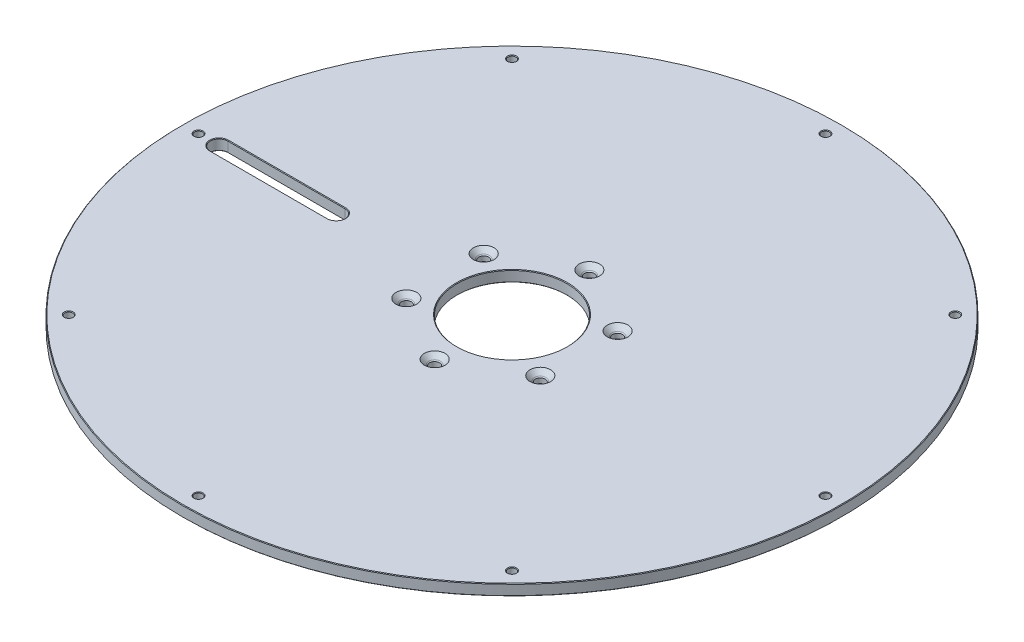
ISO-10303-21;
HEADER;
FILE_DESCRIPTION(('STEP AP214'),'2;1');
FILE_NAME('part.step','',(''),(''),'','','');
FILE_SCHEMA(('AUTOMOTIVE_DESIGN { 1 0 10303 214 1 1 1 1 }'));
ENDSEC;
DATA;
#1=APPLICATION_CONTEXT('core data for automotive mechanical design processes');
#2=APPLICATION_PROTOCOL_DEFINITION('international standard','automotive_design',2000,#1);
#3=PRODUCT_CONTEXT('',#1,'mechanical');
#4=PRODUCT('Part','Part','',(#3));
#5=PRODUCT_RELATED_PRODUCT_CATEGORY('part','',(#4));
#6=PRODUCT_DEFINITION_FORMATION('','',#4);
#7=PRODUCT_DEFINITION_CONTEXT('part definition',#1,'design');
#8=PRODUCT_DEFINITION('design','',#6,#7);
#9=PRODUCT_DEFINITION_SHAPE('','',#8);
#10=(LENGTH_UNIT() NAMED_UNIT(*) SI_UNIT(.MILLI.,.METRE.));
#11=(NAMED_UNIT(*) PLANE_ANGLE_UNIT() SI_UNIT($,.RADIAN.));
#12=(NAMED_UNIT(*) SI_UNIT($,.STERADIAN.) SOLID_ANGLE_UNIT());
#13=UNCERTAINTY_MEASURE_WITH_UNIT(LENGTH_MEASURE(1.E-05),#10,'distance_accuracy_value','');
#14=(GEOMETRIC_REPRESENTATION_CONTEXT(3) GLOBAL_UNCERTAINTY_ASSIGNED_CONTEXT((#13)) GLOBAL_UNIT_ASSIGNED_CONTEXT((#10,
#11,#12)) REPRESENTATION_CONTEXT('',''));
#15=CARTESIAN_POINT('',(0.,0.,0.));
#16=DIRECTION('',(0.,0.,1.));
#17=DIRECTION('',(1.,0.,0.));
#18=AXIS2_PLACEMENT_3D('',#15,#16,#17);
#19=CARTESIAN_POINT('',(-23.8125,0.,0.));
#20=DIRECTION('',(0.,-1.,0.));
#21=DIRECTION('',(0.,0.,-1.));
#22=AXIS2_PLACEMENT_3D('',#19,#20,#21);
#23=PLANE('',#22);
#24=CARTESIAN_POINT('',(-29.0360997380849,0.,16.7639999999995));
#25=DIRECTION('',(0.,-1.,0.));
#26=DIRECTION('',(0.,0.,-1.));
#27=AXIS2_PLACEMENT_3D('',#24,#25,#26);
#28=CIRCLE('',#27,4.47040000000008);
#29=CARTESIAN_POINT('',(-29.0360997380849,0.,12.2935999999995));
#30=VERTEX_POINT('',#29);
#31=EDGE_CURVE('E301',#30,#30,#28,.T.);
#32=ORIENTED_EDGE('',*,*,#31,.T.);
#33=EDGE_LOOP('',(#32));
#34=FACE_BOUND('',#33,.T.);
#35=CARTESIAN_POINT('',(29.0360997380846,0.,16.7640000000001));
#36=DIRECTION('',(0.,-1.,0.));
#37=DIRECTION('',(0.,0.,-1.));
#38=AXIS2_PLACEMENT_3D('',#35,#36,#37);
#39=CIRCLE('',#38,4.47040000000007);
#40=CARTESIAN_POINT('',(29.0360997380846,0.,12.2936000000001));
#41=VERTEX_POINT('',#40);
#42=EDGE_CURVE('E297',#41,#41,#39,.T.);
#43=ORIENTED_EDGE('',*,*,#42,.T.);
#44=EDGE_LOOP('',(#43));
#45=FACE_BOUND('',#44,.T.);
#46=CARTESIAN_POINT('',(2.28983498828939E-13,0.,-33.528));
#47=DIRECTION('',(0.,-1.,0.));
#48=DIRECTION('',(0.,0.,-1.));
#49=AXIS2_PLACEMENT_3D('',#46,#47,#48);
#50=CIRCLE('',#49,4.47040000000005);
#51=CARTESIAN_POINT('',(2.28983498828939E-13,0.,-37.9984000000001));
#52=VERTEX_POINT('',#51);
#53=EDGE_CURVE('E294',#52,#52,#50,.T.);
#54=ORIENTED_EDGE('',*,*,#53,.T.);
#55=EDGE_LOOP('',(#54));
#56=FACE_BOUND('',#55,.T.);
#57=CARTESIAN_POINT('',(-29.0360997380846,0.,-16.7640000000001));
#58=DIRECTION('',(0.,-1.,0.));
#59=DIRECTION('',(0.,0.,-1.));
#60=AXIS2_PLACEMENT_3D('',#57,#58,#59);
#61=CIRCLE('',#60,4.47040000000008);
#62=CARTESIAN_POINT('',(-29.0360997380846,0.,-21.2344000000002));
#63=VERTEX_POINT('',#62);
#64=EDGE_CURVE('E291',#63,#63,#61,.T.);
#65=ORIENTED_EDGE('',*,*,#64,.T.);
#66=EDGE_LOOP('',(#65));
#67=FACE_BOUND('',#66,.T.);
#68=CARTESIAN_POINT('',(135.89,0.,1.42337219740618E-12));
#69=DIRECTION('',(0.,-1.,0.));
#70=DIRECTION('',(0.,0.,-1.));
#71=AXIS2_PLACEMENT_3D('',#68,#69,#70);
#72=CIRCLE('',#71,1.98120000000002);
#73=CARTESIAN_POINT('',(135.89,0.,-1.98119999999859));
#74=VERTEX_POINT('',#73);
#75=EDGE_CURVE('E288',#74,#74,#72,.T.);
#76=ORIENTED_EDGE('',*,*,#75,.T.);
#77=EDGE_LOOP('',(#76));
#78=FACE_BOUND('',#77,.T.);
#79=CARTESIAN_POINT('',(0.,0.,-135.89));
#80=DIRECTION('',(0.,-1.,0.));
#81=DIRECTION('',(0.,0.,-1.));
#82=AXIS2_PLACEMENT_3D('',#79,#80,#81);
#83=CIRCLE('',#82,1.98120000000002);
#84=CARTESIAN_POINT('',(0.,0.,-137.8712));
#85=VERTEX_POINT('',#84);
#86=EDGE_CURVE('E285',#85,#85,#83,.T.);
#87=ORIENTED_EDGE('',*,*,#86,.T.);
#88=EDGE_LOOP('',(#87));
#89=FACE_BOUND('',#88,.T.);
#90=CARTESIAN_POINT('',(-135.89,0.,-4.74457399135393E-13));
#91=DIRECTION('',(0.,-1.,0.));
#92=DIRECTION('',(0.,0.,-1.));
#93=AXIS2_PLACEMENT_3D('',#90,#91,#92);
#94=CIRCLE('',#93,1.98119999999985);
#95=CARTESIAN_POINT('',(-135.89,0.,-1.98120000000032));
#96=VERTEX_POINT('',#95);
#97=EDGE_CURVE('E282',#96,#96,#94,.T.);
#98=ORIENTED_EDGE('',*,*,#97,.T.);
#99=EDGE_LOOP('',(#98));
#100=FACE_BOUND('',#99,.T.);
#101=CARTESIAN_POINT('',(-96.0887404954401,0.,96.0887404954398));
#102=DIRECTION('',(0.,-1.,0.));
#103=DIRECTION('',(0.,0.,-1.));
#104=AXIS2_PLACEMENT_3D('',#101,#102,#103);
#105=CIRCLE('',#104,1.98120000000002);
#106=CARTESIAN_POINT('',(-96.0887404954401,0.,94.1075404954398));
#107=VERTEX_POINT('',#106);
#108=EDGE_CURVE('E279',#107,#107,#105,.T.);
#109=ORIENTED_EDGE('',*,*,#108,.T.);
#110=EDGE_LOOP('',(#109));
#111=FACE_BOUND('',#110,.T.);
#112=CARTESIAN_POINT('',(0.,0.,135.89));
#113=DIRECTION('',(0.,-1.,0.));
#114=DIRECTION('',(0.,0.,-1.));
#115=AXIS2_PLACEMENT_3D('',#112,#113,#114);
#116=CIRCLE('',#115,1.98120000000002);
#117=CARTESIAN_POINT('',(0.,0.,133.9088));
#118=VERTEX_POINT('',#117);
#119=EDGE_CURVE('E276',#118,#118,#116,.T.);
#120=ORIENTED_EDGE('',*,*,#119,.T.);
#121=EDGE_LOOP('',(#120));
#122=FACE_BOUND('',#121,.T.);
#123=DIRECTION('',(1.,0.,0.));
#124=VECTOR('',#123,1.);
#125=CARTESIAN_POINT('',(-23.8125,0.,-4.06400000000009));
#126=LINE('',#125,#124);
#127=CARTESIAN_POINT('',(-127.,0.,-4.06400000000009));
#128=VERTEX_POINT('',#127);
#129=CARTESIAN_POINT('',(-76.2,0.,-4.06400000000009));
#130=VERTEX_POINT('',#129);
#131=EDGE_CURVE('E56',#128,#130,#126,.T.);
#132=ORIENTED_EDGE('',*,*,#131,.T.);
#133=CARTESIAN_POINT('',(-76.2,0.,0.));
#134=DIRECTION('',(0.,-1.,0.));
#135=DIRECTION('',(0.,0.,-1.));
#136=AXIS2_PLACEMENT_3D('',#133,#134,#135);
#137=CIRCLE('',#136,4.06400000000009);
#138=CARTESIAN_POINT('',(-76.2,0.,4.06400000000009));
#139=VERTEX_POINT('',#138);
#140=EDGE_CURVE('E274',#130,#139,#137,.T.);
#141=ORIENTED_EDGE('',*,*,#140,.T.);
#142=DIRECTION('',(-1.,0.,0.));
#143=VECTOR('',#142,1.);
#144=CARTESIAN_POINT('',(-23.8125,0.,4.06400000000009));
#145=LINE('',#144,#143);
#146=CARTESIAN_POINT('',(-127.,0.,4.06400000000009));
#147=VERTEX_POINT('',#146);
#148=EDGE_CURVE('E270',#139,#147,#145,.T.);
#149=ORIENTED_EDGE('',*,*,#148,.T.);
#150=CARTESIAN_POINT('',(-127.,0.,0.));
#151=DIRECTION('',(0.,-1.,0.));
#152=DIRECTION('',(0.,0.,-1.));
#153=AXIS2_PLACEMENT_3D('',#150,#151,#152);
#154=CIRCLE('',#153,4.06400000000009);
#155=EDGE_CURVE('E61',#147,#128,#154,.T.);
#156=ORIENTED_EDGE('',*,*,#155,.T.);
#157=EDGE_LOOP('',(#132,#141,#149,#156));
#158=FACE_BOUND('',#157,.T.);
#159=CARTESIAN_POINT('',(0.,0.,0.));
#160=DIRECTION('',(0.,-1.,0.));
#161=DIRECTION('',(0.,0.,-1.));
#162=AXIS2_PLACEMENT_3D('',#159,#160,#161);
#163=CIRCLE('',#162,142.621);
#164=CARTESIAN_POINT('',(0.,0.,-142.621));
#165=VERTEX_POINT('',#164);
#166=EDGE_CURVE('E266',#165,#165,#163,.F.);
#167=ORIENTED_EDGE('',*,*,#166,.T.);
#168=EDGE_LOOP('',(#167));
#169=FACE_BOUND('',#168,.T.);
#170=CARTESIAN_POINT('',(0.,0.,0.));
#171=DIRECTION('',(0.,-1.,0.));
#172=DIRECTION('',(0.,0.,-1.));
#173=AXIS2_PLACEMENT_3D('',#170,#171,#172);
#174=CIRCLE('',#173,24.0665);
#175=CARTESIAN_POINT('',(0.,0.,-24.0665));
#176=VERTEX_POINT('',#175);
#177=EDGE_CURVE('E262',#176,#176,#174,.T.);
#178=ORIENTED_EDGE('',*,*,#177,.T.);
#179=EDGE_LOOP('',(#178));
#180=FACE_BOUND('',#179,.T.);
#181=CARTESIAN_POINT('',(-96.0887404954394,0.,-96.0887404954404));
#182=DIRECTION('',(0.,-1.,0.));
#183=DIRECTION('',(0.,0.,-1.));
#184=AXIS2_PLACEMENT_3D('',#181,#182,#183);
#185=CIRCLE('',#184,1.98120000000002);
#186=CARTESIAN_POINT('',(-96.0887404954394,0.,-98.0699404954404));
#187=VERTEX_POINT('',#186);
#188=EDGE_CURVE('E259',#187,#187,#185,.T.);
#189=ORIENTED_EDGE('',*,*,#188,.T.);
#190=EDGE_LOOP('',(#189));
#191=FACE_BOUND('',#190,.T.);
#192=CARTESIAN_POINT('',(96.0887404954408,0.,-96.0887404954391));
#193=DIRECTION('',(0.,-1.,0.));
#194=DIRECTION('',(0.,0.,-1.));
#195=AXIS2_PLACEMENT_3D('',#192,#193,#194);
#196=CIRCLE('',#195,1.98120000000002);
#197=CARTESIAN_POINT('',(96.0887404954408,0.,-98.0699404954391));
#198=VERTEX_POINT('',#197);
#199=EDGE_CURVE('E256',#198,#198,#196,.T.);
#200=ORIENTED_EDGE('',*,*,#199,.T.);
#201=EDGE_LOOP('',(#200));
#202=FACE_BOUND('',#201,.T.);
#203=CARTESIAN_POINT('',(96.0887404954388,0.,96.0887404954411));
#204=DIRECTION('',(0.,-1.,0.));
#205=DIRECTION('',(0.,0.,-1.));
#206=AXIS2_PLACEMENT_3D('',#203,#204,#205);
#207=CIRCLE('',#206,1.98120000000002);
#208=CARTESIAN_POINT('',(96.0887404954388,0.,94.1075404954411));
#209=VERTEX_POINT('',#208);
#210=EDGE_CURVE('E253',#209,#209,#207,.T.);
#211=ORIENTED_EDGE('',*,*,#210,.T.);
#212=EDGE_LOOP('',(#211));
#213=FACE_BOUND('',#212,.T.);
#214=CARTESIAN_POINT('',(29.0360997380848,0.,-16.7639999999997));
#215=DIRECTION('',(0.,-1.,0.));
#216=DIRECTION('',(0.,0.,-1.));
#217=AXIS2_PLACEMENT_3D('',#214,#215,#216);
#218=CIRCLE('',#217,4.47040000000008);
#219=CARTESIAN_POINT('',(29.0360997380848,0.,-21.2343999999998));
#220=VERTEX_POINT('',#219);
#221=EDGE_CURVE('E250',#220,#220,#218,.T.);
#222=ORIENTED_EDGE('',*,*,#221,.T.);
#223=EDGE_LOOP('',(#222));
#224=FACE_BOUND('',#223,.T.);
#225=CARTESIAN_POINT('',(-4.63171168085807E-13,0.,33.528));
#226=DIRECTION('',(0.,-1.,0.));
#227=DIRECTION('',(0.,0.,-1.));
#228=AXIS2_PLACEMENT_3D('',#225,#226,#227);
#229=CIRCLE('',#228,4.47040000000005);
#230=CARTESIAN_POINT('',(-4.63171168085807E-13,0.,29.0576));
#231=VERTEX_POINT('',#230);
#232=EDGE_CURVE('E247',#231,#231,#229,.T.);
#233=ORIENTED_EDGE('',*,*,#232,.T.);
#234=EDGE_LOOP('',(#233));
#235=FACE_BOUND('',#234,.T.);
#236=ADVANCED_FACE('F39',(#34,#45,#56,#67,#78,#89,#100,#111,#122,#158,#169,#180,#191,#202,#213,
#224,#235),#23,.F.);
#237=CARTESIAN_POINT('',(0.,0.,0.));
#238=DIRECTION('',(0.,-1.,0.));
#239=DIRECTION('',(0.,0.,-1.));
#240=AXIS2_PLACEMENT_3D('',#237,#238,#239);
#241=CYLINDRICAL_SURFACE('',#240,23.8125);
#242=CARTESIAN_POINT('',(0.,-4.50849999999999,0.));
#243=DIRECTION('',(0.,1.,0.));
#244=DIRECTION('',(0.,0.,1.));
#245=AXIS2_PLACEMENT_3D('',#242,#243,#244);
#246=CIRCLE('',#245,23.8125);
#247=CARTESIAN_POINT('',(0.,-4.50849999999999,23.8125));
#248=VERTEX_POINT('',#247);
#249=EDGE_CURVE('E157',#248,#248,#246,.F.);
#250=ORIENTED_EDGE('',*,*,#249,.T.);
#251=EDGE_LOOP('',(#250));
#252=FACE_BOUND('',#251,.T.);
#253=CARTESIAN_POINT('',(0.,-0.253999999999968,0.));
#254=DIRECTION('',(0.,-1.,0.));
#255=DIRECTION('',(0.,0.,-1.));
#256=AXIS2_PLACEMENT_3D('',#253,#254,#255);
#257=CIRCLE('',#256,23.8125);
#258=CARTESIAN_POINT('',(0.,-0.253999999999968,-23.8125));
#259=VERTEX_POINT('',#258);
#260=EDGE_CURVE('E153',#259,#259,#257,.F.);
#261=ORIENTED_EDGE('',*,*,#260,.T.);
#262=EDGE_LOOP('',(#261));
#263=FACE_BOUND('',#262,.T.);
#264=ADVANCED_FACE('F346',(#252,#263),#241,.F.);
#265=CARTESIAN_POINT('',(-23.8125,-4.76250000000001,0.));
#266=DIRECTION('',(0.,1.,0.));
#267=DIRECTION('',(0.,0.,1.));
#268=AXIS2_PLACEMENT_3D('',#265,#266,#267);
#269=PLANE('',#268);
#270=CARTESIAN_POINT('',(0.,-4.76250000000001,0.));
#271=DIRECTION('',(0.,1.,0.));
#272=DIRECTION('',(0.,0.,1.));
#273=AXIS2_PLACEMENT_3D('',#270,#271,#272);
#274=CIRCLE('',#273,142.621);
#275=CARTESIAN_POINT('',(0.,-4.76250000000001,142.621));
#276=VERTEX_POINT('',#275);
#277=EDGE_CURVE('E137',#276,#276,#274,.F.);
#278=ORIENTED_EDGE('',*,*,#277,.T.);
#279=EDGE_LOOP('',(#278));
#280=FACE_BOUND('',#279,.T.);
#281=CARTESIAN_POINT('',(0.,-4.76250000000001,0.));
#282=DIRECTION('',(0.,1.,0.));
#283=DIRECTION('',(0.,0.,1.));
#284=AXIS2_PLACEMENT_3D('',#281,#282,#283);
#285=CIRCLE('',#284,24.0665);
#286=CARTESIAN_POINT('',(0.,-4.76250000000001,24.0665));
#287=VERTEX_POINT('',#286);
#288=EDGE_CURVE('E133',#287,#287,#285,.T.);
#289=ORIENTED_EDGE('',*,*,#288,.T.);
#290=EDGE_LOOP('',(#289));
#291=FACE_BOUND('',#290,.T.);
#292=DIRECTION('',(1.,0.,0.));
#293=VECTOR('',#292,1.);
#294=CARTESIAN_POINT('',(-23.8125,-4.76250000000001,4.06399999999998));
#295=LINE('',#294,#293);
#296=CARTESIAN_POINT('',(-127.,-4.76250000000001,4.06399999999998));
#297=VERTEX_POINT('',#296);
#298=CARTESIAN_POINT('',(-76.2,-4.76250000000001,4.06399999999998));
#299=VERTEX_POINT('',#298);
#300=EDGE_CURVE('E131',#297,#299,#295,.T.);
#301=ORIENTED_EDGE('',*,*,#300,.T.);
#302=CARTESIAN_POINT('',(-76.2,-4.76250000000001,0.));
#303=DIRECTION('',(0.,1.,0.));
#304=DIRECTION('',(0.,0.,1.));
#305=AXIS2_PLACEMENT_3D('',#302,#303,#304);
#306=CIRCLE('',#305,4.06399999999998);
#307=CARTESIAN_POINT('',(-76.2,-4.76250000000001,-4.06399999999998));
#308=VERTEX_POINT('',#307);
#309=EDGE_CURVE('E111',#299,#308,#306,.T.);
#310=ORIENTED_EDGE('',*,*,#309,.T.);
#311=DIRECTION('',(-1.,0.,0.));
#312=VECTOR('',#311,1.);
#313=CARTESIAN_POINT('',(-23.8125,-4.76250000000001,-4.06399999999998));
#314=LINE('',#313,#312);
#315=CARTESIAN_POINT('',(-127.,-4.76250000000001,-4.06399999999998));
#316=VERTEX_POINT('',#315);
#317=EDGE_CURVE('E119',#308,#316,#314,.T.);
#318=ORIENTED_EDGE('',*,*,#317,.T.);
#319=CARTESIAN_POINT('',(-127.,-4.76250000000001,0.));
#320=DIRECTION('',(0.,1.,0.));
#321=DIRECTION('',(0.,0.,1.));
#322=AXIS2_PLACEMENT_3D('',#319,#320,#321);
#323=CIRCLE('',#322,4.06399999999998);
#324=EDGE_CURVE('E125',#316,#297,#323,.T.);
#325=ORIENTED_EDGE('',*,*,#324,.T.);
#326=EDGE_LOOP('',(#301,#310,#318,#325));
#327=FACE_BOUND('',#326,.T.);
#328=CARTESIAN_POINT('',(0.,-4.76250000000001,135.89));
#329=DIRECTION('',(0.,1.,0.));
#330=DIRECTION('',(0.,0.,1.));
#331=AXIS2_PLACEMENT_3D('',#328,#329,#330);
#332=CIRCLE('',#331,1.98119999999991);
#333=CARTESIAN_POINT('',(0.,-4.76250000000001,137.8712));
#334=VERTEX_POINT('',#333);
#335=EDGE_CURVE('E126',#334,#334,#332,.T.);
#336=ORIENTED_EDGE('',*,*,#335,.T.);
#337=EDGE_LOOP('',(#336));
#338=FACE_BOUND('',#337,.T.);
#339=CARTESIAN_POINT('',(-96.0887404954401,-4.76250000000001,96.0887404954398));
#340=DIRECTION('',(0.,1.,0.));
#341=DIRECTION('',(0.,0.,1.));
#342=AXIS2_PLACEMENT_3D('',#339,#340,#341);
#343=CIRCLE('',#342,1.98120000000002);
#344=CARTESIAN_POINT('',(-96.0887404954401,-4.76250000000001,98.0699404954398));
#345=VERTEX_POINT('',#344);
#346=EDGE_CURVE('E444',#345,#345,#343,.T.);
#347=ORIENTED_EDGE('',*,*,#346,.T.);
#348=EDGE_LOOP('',(#347));
#349=FACE_BOUND('',#348,.T.);
#350=CARTESIAN_POINT('',(-135.89,-4.76250000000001,-4.74457399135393E-13));
#351=DIRECTION('',(0.,1.,0.));
#352=DIRECTION('',(0.,0.,1.));
#353=AXIS2_PLACEMENT_3D('',#350,#351,#352);
#354=CIRCLE('',#353,1.98119999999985);
#355=CARTESIAN_POINT('',(-135.89,-4.76250000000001,1.98119999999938));
#356=VERTEX_POINT('',#355);
#357=EDGE_CURVE('E441',#356,#356,#354,.T.);
#358=ORIENTED_EDGE('',*,*,#357,.T.);
#359=EDGE_LOOP('',(#358));
#360=FACE_BOUND('',#359,.T.);
#361=CARTESIAN_POINT('',(-96.0887404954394,-4.76250000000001,-96.0887404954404));
#362=DIRECTION('',(0.,1.,0.));
#363=DIRECTION('',(0.,0.,1.));
#364=AXIS2_PLACEMENT_3D('',#361,#362,#363);
#365=CIRCLE('',#364,1.98120000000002);
#366=CARTESIAN_POINT('',(-96.0887404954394,-4.76250000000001,-94.1075404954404));
#367=VERTEX_POINT('',#366);
#368=EDGE_CURVE('E438',#367,#367,#365,.T.);
#369=ORIENTED_EDGE('',*,*,#368,.T.);
#370=EDGE_LOOP('',(#369));
#371=FACE_BOUND('',#370,.T.);
#372=CARTESIAN_POINT('',(0.,-4.76250000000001,-135.89));
#373=DIRECTION('',(0.,1.,0.));
#374=DIRECTION('',(0.,0.,1.));
#375=AXIS2_PLACEMENT_3D('',#372,#373,#374);
#376=CIRCLE('',#375,1.98119999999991);
#377=CARTESIAN_POINT('',(0.,-4.76250000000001,-133.9088));
#378=VERTEX_POINT('',#377);
#379=EDGE_CURVE('E435',#378,#378,#376,.T.);
#380=ORIENTED_EDGE('',*,*,#379,.T.);
#381=EDGE_LOOP('',(#380));
#382=FACE_BOUND('',#381,.T.);
#383=CARTESIAN_POINT('',(96.0887404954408,-4.76250000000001,-96.0887404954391));
#384=DIRECTION('',(0.,1.,0.));
#385=DIRECTION('',(0.,0.,1.));
#386=AXIS2_PLACEMENT_3D('',#383,#384,#385);
#387=CIRCLE('',#386,1.98120000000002);
#388=CARTESIAN_POINT('',(96.0887404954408,-4.76250000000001,-94.1075404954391));
#389=VERTEX_POINT('',#388);
#390=EDGE_CURVE('E432',#389,#389,#387,.T.);
#391=ORIENTED_EDGE('',*,*,#390,.T.);
#392=EDGE_LOOP('',(#391));
#393=FACE_BOUND('',#392,.T.);
#394=CARTESIAN_POINT('',(135.89,-4.76250000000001,1.42337219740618E-12));
#395=DIRECTION('',(0.,1.,0.));
#396=DIRECTION('',(0.,0.,1.));
#397=AXIS2_PLACEMENT_3D('',#394,#395,#396);
#398=CIRCLE('',#397,1.98119999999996);
#399=CARTESIAN_POINT('',(135.89,-4.76250000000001,1.98120000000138));
#400=VERTEX_POINT('',#399);
#401=EDGE_CURVE('E429',#400,#400,#398,.T.);
#402=ORIENTED_EDGE('',*,*,#401,.T.);
#403=EDGE_LOOP('',(#402));
#404=FACE_BOUND('',#403,.T.);
#405=CARTESIAN_POINT('',(96.0887404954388,-4.76250000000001,96.0887404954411));
#406=DIRECTION('',(0.,1.,0.));
#407=DIRECTION('',(0.,0.,1.));
#408=AXIS2_PLACEMENT_3D('',#405,#406,#407);
#409=CIRCLE('',#408,1.98120000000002);
#410=CARTESIAN_POINT('',(96.0887404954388,-4.76250000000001,98.0699404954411));
#411=VERTEX_POINT('',#410);
#412=EDGE_CURVE('E426',#411,#411,#409,.T.);
#413=ORIENTED_EDGE('',*,*,#412,.T.);
#414=EDGE_LOOP('',(#413));
#415=FACE_BOUND('',#414,.T.);
#416=CARTESIAN_POINT('',(-29.0360997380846,-4.76250000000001,-16.7640000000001));
#417=DIRECTION('',(0.,1.,0.));
#418=DIRECTION('',(0.,0.,1.));
#419=AXIS2_PLACEMENT_3D('',#416,#417,#418);
#420=CIRCLE('',#419,2.40665000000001);
#421=CARTESIAN_POINT('',(-29.0360997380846,-4.76250000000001,-14.3573500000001));
#422=VERTEX_POINT('',#421);
#423=EDGE_CURVE('E423',#422,#422,#420,.T.);
#424=ORIENTED_EDGE('',*,*,#423,.T.);
#425=EDGE_LOOP('',(#424));
#426=FACE_BOUND('',#425,.T.);
#427=CARTESIAN_POINT('',(2.28983498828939E-13,-4.76250000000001,-33.528));
#428=DIRECTION('',(0.,1.,0.));
#429=DIRECTION('',(0.,0.,1.));
#430=AXIS2_PLACEMENT_3D('',#427,#428,#429);
#431=CIRCLE('',#430,2.40664999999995);
#432=CARTESIAN_POINT('',(2.28983498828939E-13,-4.76250000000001,-31.12135));
#433=VERTEX_POINT('',#432);
#434=EDGE_CURVE('E420',#433,#433,#431,.T.);
#435=ORIENTED_EDGE('',*,*,#434,.T.);
#436=EDGE_LOOP('',(#435));
#437=FACE_BOUND('',#436,.T.);
#438=CARTESIAN_POINT('',(29.0360997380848,-4.76250000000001,-16.7639999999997));
#439=DIRECTION('',(0.,1.,0.));
#440=DIRECTION('',(0.,0.,1.));
#441=AXIS2_PLACEMENT_3D('',#438,#439,#440);
#442=CIRCLE('',#441,2.40665000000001);
#443=CARTESIAN_POINT('',(29.0360997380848,-4.76250000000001,-14.3573499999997));
#444=VERTEX_POINT('',#443);
#445=EDGE_CURVE('E417',#444,#444,#442,.T.);
#446=ORIENTED_EDGE('',*,*,#445,.T.);
#447=EDGE_LOOP('',(#446));
#448=FACE_BOUND('',#447,.T.);
#449=CARTESIAN_POINT('',(29.0360997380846,-4.76250000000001,16.7640000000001));
#450=DIRECTION('',(0.,1.,0.));
#451=DIRECTION('',(0.,0.,1.));
#452=AXIS2_PLACEMENT_3D('',#449,#450,#451);
#453=CIRCLE('',#452,2.4066499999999);
#454=CARTESIAN_POINT('',(29.0360997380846,-4.76250000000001,19.17065));
#455=VERTEX_POINT('',#454);
#456=EDGE_CURVE('E413',#455,#455,#453,.T.);
#457=ORIENTED_EDGE('',*,*,#456,.T.);
#458=EDGE_LOOP('',(#457));
#459=FACE_BOUND('',#458,.T.);
#460=CARTESIAN_POINT('',(-4.63171168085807E-13,-4.76250000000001,33.528));
#461=DIRECTION('',(0.,1.,0.));
#462=DIRECTION('',(0.,0.,1.));
#463=AXIS2_PLACEMENT_3D('',#460,#461,#462);
#464=CIRCLE('',#463,2.40664999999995);
#465=CARTESIAN_POINT('',(-4.63171168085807E-13,-4.76250000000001,35.93465));
#466=VERTEX_POINT('',#465);
#467=EDGE_CURVE('E410',#466,#466,#464,.T.);
#468=ORIENTED_EDGE('',*,*,#467,.T.);
#469=EDGE_LOOP('',(#468));
#470=FACE_BOUND('',#469,.T.);
#471=CARTESIAN_POINT('',(-29.0360997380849,-4.76250000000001,16.7639999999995));
#472=DIRECTION('',(0.,1.,0.));
#473=DIRECTION('',(0.,0.,1.));
#474=AXIS2_PLACEMENT_3D('',#471,#472,#473);
#475=CIRCLE('',#474,2.40665000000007);
#476=CARTESIAN_POINT('',(-29.0360997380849,-4.76250000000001,19.1706499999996));
#477=VERTEX_POINT('',#476);
#478=EDGE_CURVE('E399',#477,#477,#475,.T.);
#479=ORIENTED_EDGE('',*,*,#478,.T.);
#480=EDGE_LOOP('',(#479));
#481=FACE_BOUND('',#480,.T.);
#482=ADVANCED_FACE('F128',(#280,#291,#327,#338,#349,#360,#371,#382,#393,#404,#415,#426,#437,
#448,#459,#470,#481),#269,.F.);
#483=CARTESIAN_POINT('',(0.,0.,0.));
#484=DIRECTION('',(0.,-1.,0.));
#485=DIRECTION('',(0.,0.,-1.));
#486=AXIS2_PLACEMENT_3D('',#483,#484,#485);
#487=CYLINDRICAL_SURFACE('',#486,142.875);
#488=CARTESIAN_POINT('',(0.,-4.5085,0.));
#489=DIRECTION('',(0.,1.,0.));
#490=DIRECTION('',(0.,0.,1.));
#491=AXIS2_PLACEMENT_3D('',#488,#489,#490);
#492=CIRCLE('',#491,142.875);
#493=CARTESIAN_POINT('',(0.,-4.5085,142.875));
#494=VERTEX_POINT('',#493);
#495=EDGE_CURVE('E149',#494,#494,#492,.T.);
#496=ORIENTED_EDGE('',*,*,#495,.T.);
#497=EDGE_LOOP('',(#496));
#498=FACE_BOUND('',#497,.T.);
#499=CARTESIAN_POINT('',(0.,-0.254000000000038,0.));
#500=DIRECTION('',(0.,-1.,0.));
#501=DIRECTION('',(0.,0.,-1.));
#502=AXIS2_PLACEMENT_3D('',#499,#500,#501);
#503=CIRCLE('',#502,142.875);
#504=CARTESIAN_POINT('',(0.,-0.254000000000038,-142.875));
#505=VERTEX_POINT('',#504);
#506=EDGE_CURVE('E145',#505,#505,#503,.T.);
#507=ORIENTED_EDGE('',*,*,#506,.T.);
#508=EDGE_LOOP('',(#507));
#509=FACE_BOUND('',#508,.T.);
#510=ADVANCED_FACE('F474',(#498,#509),#487,.T.);
#511=CARTESIAN_POINT('',(-127.,-4.76250000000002,0.));
#512=DIRECTION('',(0.,1.,0.));
#513=DIRECTION('',(0.,0.,1.));
#514=AXIS2_PLACEMENT_3D('',#511,#512,#513);
#515=CYLINDRICAL_SURFACE('',#514,3.81);
#516=DIRECTION('',(0.,1.,0.));
#517=VECTOR('',#516,1.);
#518=CARTESIAN_POINT('',(-127.,-4.76250000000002,3.81));
#519=LINE('',#518,#517);
#520=CARTESIAN_POINT('',(-127.,-4.50849999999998,3.81));
#521=VERTEX_POINT('',#520);
#522=CARTESIAN_POINT('',(-127.,-0.254000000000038,3.81));
#523=VERTEX_POINT('',#522);
#524=EDGE_CURVE('E395',#521,#523,#519,.T.);
#525=ORIENTED_EDGE('',*,*,#524,.F.);
#526=CARTESIAN_POINT('',(-127.,-4.50849999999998,0.));
#527=DIRECTION('',(0.,1.,0.));
#528=DIRECTION('',(0.,0.,1.));
#529=AXIS2_PLACEMENT_3D('',#526,#527,#528);
#530=CIRCLE('',#529,3.81);
#531=CARTESIAN_POINT('',(-127.,-4.50849999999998,-3.81));
#532=VERTEX_POINT('',#531);
#533=EDGE_CURVE('E171',#521,#532,#530,.F.);
#534=ORIENTED_EDGE('',*,*,#533,.T.);
#535=DIRECTION('',(0.,1.,0.));
#536=VECTOR('',#535,1.);
#537=CARTESIAN_POINT('',(-127.,-4.76250000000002,-3.81));
#538=LINE('',#537,#536);
#539=CARTESIAN_POINT('',(-127.,-0.254000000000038,-3.81));
#540=VERTEX_POINT('',#539);
#541=EDGE_CURVE('E396',#532,#540,#538,.T.);
#542=ORIENTED_EDGE('',*,*,#541,.T.);
#543=CARTESIAN_POINT('',(-127.,-0.254000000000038,0.));
#544=DIRECTION('',(0.,-1.,0.));
#545=DIRECTION('',(0.,0.,-1.));
#546=AXIS2_PLACEMENT_3D('',#543,#544,#545);
#547=CIRCLE('',#546,3.81);
#548=EDGE_CURVE('E169',#540,#523,#547,.F.);
#549=ORIENTED_EDGE('',*,*,#548,.T.);
#550=EDGE_LOOP('',(#525,#534,#542,#549));
#551=FACE_BOUND('',#550,.T.);
#552=ADVANCED_FACE('F463',(#551),#515,.F.);
#553=CARTESIAN_POINT('',(-76.2,-4.76250000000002,-3.81));
#554=DIRECTION('',(0.,0.,-1.));
#555=DIRECTION('',(-1.,0.,0.));
#556=AXIS2_PLACEMENT_3D('',#553,#554,#555);
#557=PLANE('',#556);
#558=ORIENTED_EDGE('',*,*,#541,.F.);
#559=DIRECTION('',(1.,0.,0.));
#560=VECTOR('',#559,1.);
#561=CARTESIAN_POINT('',(-76.2,-4.50849999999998,-3.81));
#562=LINE('',#561,#560);
#563=CARTESIAN_POINT('',(-76.2,-4.50849999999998,-3.81));
#564=VERTEX_POINT('',#563);
#565=EDGE_CURVE('E175',#532,#564,#562,.T.);
#566=ORIENTED_EDGE('',*,*,#565,.T.);
#567=DIRECTION('',(0.,1.,0.));
#568=VECTOR('',#567,1.);
#569=CARTESIAN_POINT('',(-76.2,-4.76250000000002,-3.81));
#570=LINE('',#569,#568);
#571=CARTESIAN_POINT('',(-76.2,-0.254000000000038,-3.81));
#572=VERTEX_POINT('',#571);
#573=EDGE_CURVE('E400',#564,#572,#570,.T.);
#574=ORIENTED_EDGE('',*,*,#573,.T.);
#575=DIRECTION('',(-1.,0.,0.));
#576=VECTOR('',#575,1.);
#577=CARTESIAN_POINT('',(-76.2,-0.254000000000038,-3.81));
#578=LINE('',#577,#576);
#579=EDGE_CURVE('E173',#572,#540,#578,.T.);
#580=ORIENTED_EDGE('',*,*,#579,.T.);
#581=EDGE_LOOP('',(#558,#566,#574,#580));
#582=FACE_BOUND('',#581,.T.);
#583=ADVANCED_FACE('F466',(#582),#557,.F.);
#584=CARTESIAN_POINT('',(-76.2,-4.76250000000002,0.));
#585=DIRECTION('',(0.,1.,0.));
#586=DIRECTION('',(0.,0.,1.));
#587=AXIS2_PLACEMENT_3D('',#584,#585,#586);
#588=CYLINDRICAL_SURFACE('',#587,3.81);
#589=ORIENTED_EDGE('',*,*,#573,.F.);
#590=CARTESIAN_POINT('',(-76.2,-4.50849999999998,0.));
#591=DIRECTION('',(0.,1.,0.));
#592=DIRECTION('',(0.,0.,1.));
#593=AXIS2_PLACEMENT_3D('',#590,#591,#592);
#594=CIRCLE('',#593,3.81);
#595=CARTESIAN_POINT('',(-76.2,-4.50849999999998,3.81));
#596=VERTEX_POINT('',#595);
#597=EDGE_CURVE('E113',#564,#596,#594,.F.);
#598=ORIENTED_EDGE('',*,*,#597,.T.);
#599=DIRECTION('',(0.,1.,0.));
#600=VECTOR('',#599,1.);
#601=CARTESIAN_POINT('',(-76.2,-4.76250000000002,3.81));
#602=LINE('',#601,#600);
#603=CARTESIAN_POINT('',(-76.2,-0.254000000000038,3.81));
#604=VERTEX_POINT('',#603);
#605=EDGE_CURVE('E403',#596,#604,#602,.T.);
#606=ORIENTED_EDGE('',*,*,#605,.T.);
#607=CARTESIAN_POINT('',(-76.2,-0.254000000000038,0.));
#608=DIRECTION('',(0.,-1.,0.));
#609=DIRECTION('',(0.,0.,-1.));
#610=AXIS2_PLACEMENT_3D('',#607,#608,#609);
#611=CIRCLE('',#610,3.81);
#612=EDGE_CURVE('E161',#604,#572,#611,.F.);
#613=ORIENTED_EDGE('',*,*,#612,.T.);
#614=EDGE_LOOP('',(#589,#598,#606,#613));
#615=FACE_BOUND('',#614,.T.);
#616=ADVANCED_FACE('F460',(#615),#588,.F.);
#617=CARTESIAN_POINT('',(-76.2,-4.76250000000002,3.81));
#618=DIRECTION('',(0.,0.,1.));
#619=DIRECTION('',(1.,0.,0.));
#620=AXIS2_PLACEMENT_3D('',#617,#618,#619);
#621=PLANE('',#620);
#622=ORIENTED_EDGE('',*,*,#605,.F.);
#623=DIRECTION('',(-1.,0.,0.));
#624=VECTOR('',#623,1.);
#625=CARTESIAN_POINT('',(-76.2,-4.50849999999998,3.81));
#626=LINE('',#625,#624);
#627=EDGE_CURVE('E167',#596,#521,#626,.T.);
#628=ORIENTED_EDGE('',*,*,#627,.T.);
#629=ORIENTED_EDGE('',*,*,#524,.T.);
#630=DIRECTION('',(1.,0.,0.));
#631=VECTOR('',#630,1.);
#632=CARTESIAN_POINT('',(-76.2,-0.254000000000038,3.81));
#633=LINE('',#632,#631);
#634=EDGE_CURVE('E165',#523,#604,#633,.T.);
#635=ORIENTED_EDGE('',*,*,#634,.T.);
#636=EDGE_LOOP('',(#622,#628,#629,#635));
#637=FACE_BOUND('',#636,.T.);
#638=ADVANCED_FACE('F461',(#637),#621,.F.);
#639=CARTESIAN_POINT('',(0.,0.,135.89));
#640=DIRECTION('',(0.,1.,0.));
#641=DIRECTION('',(0.,0.,1.));
#642=AXIS2_PLACEMENT_3D('',#639,#640,#641);
#643=CYLINDRICAL_SURFACE('',#642,1.7272);
#644=CARTESIAN_POINT('',(0.,-4.50850000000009,135.89));
#645=DIRECTION('',(0.,1.,0.));
#646=DIRECTION('',(0.,0.,1.));
#647=AXIS2_PLACEMENT_3D('',#644,#645,#646);
#648=CIRCLE('',#647,1.7272);
#649=CARTESIAN_POINT('',(0.,-4.50850000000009,137.6172));
#650=VERTEX_POINT('',#649);
#651=EDGE_CURVE('E180',#650,#650,#648,.F.);
#652=ORIENTED_EDGE('',*,*,#651,.T.);
#653=EDGE_LOOP('',(#652));
#654=FACE_BOUND('',#653,.T.);
#655=CARTESIAN_POINT('',(0.,-0.254000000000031,135.89));
#656=DIRECTION('',(0.,-1.,0.));
#657=DIRECTION('',(0.,0.,-1.));
#658=AXIS2_PLACEMENT_3D('',#655,#656,#657);
#659=CIRCLE('',#658,1.7272);
#660=CARTESIAN_POINT('',(0.,-0.254000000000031,134.1628));
#661=VERTEX_POINT('',#660);
#662=EDGE_CURVE('E177',#661,#661,#659,.F.);
#663=ORIENTED_EDGE('',*,*,#662,.T.);
#664=EDGE_LOOP('',(#663));
#665=FACE_BOUND('',#664,.T.);
#666=ADVANCED_FACE('F477',(#654,#665),#643,.F.);
#667=CARTESIAN_POINT('',(-96.0887404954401,0.,96.0887404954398));
#668=DIRECTION('',(0.,1.,0.));
#669=DIRECTION('',(0.,0.,1.));
#670=AXIS2_PLACEMENT_3D('',#667,#668,#669);
#671=CYLINDRICAL_SURFACE('',#670,1.7272);
#672=CARTESIAN_POINT('',(-96.0887404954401,-4.50850000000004,96.0887404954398));
#673=DIRECTION('',(0.,1.,0.));
#674=DIRECTION('',(0.,0.,1.));
#675=AXIS2_PLACEMENT_3D('',#672,#673,#674);
#676=CIRCLE('',#675,1.7272);
#677=CARTESIAN_POINT('',(-96.0887404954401,-4.50850000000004,97.8159404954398));
#678=VERTEX_POINT('',#677);
#679=EDGE_CURVE('E186',#678,#678,#676,.F.);
#680=ORIENTED_EDGE('',*,*,#679,.T.);
#681=EDGE_LOOP('',(#680));
#682=FACE_BOUND('',#681,.T.);
#683=CARTESIAN_POINT('',(-96.0887404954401,-0.25400000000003,96.0887404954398));
#684=DIRECTION('',(0.,-1.,0.));
#685=DIRECTION('',(0.,0.,-1.));
#686=AXIS2_PLACEMENT_3D('',#683,#684,#685);
#687=CIRCLE('',#686,1.7272);
#688=CARTESIAN_POINT('',(-96.0887404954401,-0.25400000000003,94.3615404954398));
#689=VERTEX_POINT('',#688);
#690=EDGE_CURVE('E183',#689,#689,#687,.F.);
#691=ORIENTED_EDGE('',*,*,#690,.T.);
#692=EDGE_LOOP('',(#691));
#693=FACE_BOUND('',#692,.T.);
#694=ADVANCED_FACE('F687',(#682,#693),#671,.F.);
#695=CARTESIAN_POINT('',(-135.89,0.,-4.74457399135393E-13));
#696=DIRECTION('',(0.,1.,0.));
#697=DIRECTION('',(0.,0.,1.));
#698=AXIS2_PLACEMENT_3D('',#695,#696,#697);
#699=CYLINDRICAL_SURFACE('',#698,1.7272);
#700=CARTESIAN_POINT('',(-135.89,-4.50850000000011,-4.74457399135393E-13));
#701=DIRECTION('',(0.,1.,0.));
#702=DIRECTION('',(0.,0.,1.));
#703=AXIS2_PLACEMENT_3D('',#700,#701,#702);
#704=CIRCLE('',#703,1.7272);
#705=CARTESIAN_POINT('',(-135.89,-4.50850000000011,1.72719999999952));
#706=VERTEX_POINT('',#705);
#707=EDGE_CURVE('E192',#706,#706,#704,.F.);
#708=ORIENTED_EDGE('',*,*,#707,.T.);
#709=EDGE_LOOP('',(#708));
#710=FACE_BOUND('',#709,.T.);
#711=CARTESIAN_POINT('',(-135.89,-0.253999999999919,-4.74457399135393E-13));
#712=DIRECTION('',(0.,-1.,0.));
#713=DIRECTION('',(0.,0.,-1.));
#714=AXIS2_PLACEMENT_3D('',#711,#712,#713);
#715=CIRCLE('',#714,1.7272);
#716=CARTESIAN_POINT('',(-135.89,-0.253999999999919,-1.72720000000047));
#717=VERTEX_POINT('',#716);
#718=EDGE_CURVE('E189',#717,#717,#715,.F.);
#719=ORIENTED_EDGE('',*,*,#718,.T.);
#720=EDGE_LOOP('',(#719));
#721=FACE_BOUND('',#720,.T.);
#722=ADVANCED_FACE('F684',(#710,#721),#699,.F.);
#723=CARTESIAN_POINT('',(-96.0887404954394,0.,-96.0887404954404));
#724=DIRECTION('',(0.,1.,0.));
#725=DIRECTION('',(0.,0.,1.));
#726=AXIS2_PLACEMENT_3D('',#723,#724,#725);
#727=CYLINDRICAL_SURFACE('',#726,1.7272);
#728=CARTESIAN_POINT('',(-96.0887404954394,-4.50850000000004,-96.0887404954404));
#729=DIRECTION('',(0.,1.,0.));
#730=DIRECTION('',(0.,0.,1.));
#731=AXIS2_PLACEMENT_3D('',#728,#729,#730);
#732=CIRCLE('',#731,1.7272);
#733=CARTESIAN_POINT('',(-96.0887404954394,-4.50850000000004,-94.3615404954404));
#734=VERTEX_POINT('',#733);
#735=EDGE_CURVE('E198',#734,#734,#732,.F.);
#736=ORIENTED_EDGE('',*,*,#735,.T.);
#737=EDGE_LOOP('',(#736));
#738=FACE_BOUND('',#737,.T.);
#739=CARTESIAN_POINT('',(-96.0887404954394,-0.25400000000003,-96.0887404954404));
#740=DIRECTION('',(0.,-1.,0.));
#741=DIRECTION('',(0.,0.,-1.));
#742=AXIS2_PLACEMENT_3D('',#739,#740,#741);
#743=CIRCLE('',#742,1.7272);
#744=CARTESIAN_POINT('',(-96.0887404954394,-0.25400000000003,-97.8159404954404));
#745=VERTEX_POINT('',#744);
#746=EDGE_CURVE('E195',#745,#745,#743,.F.);
#747=ORIENTED_EDGE('',*,*,#746,.T.);
#748=EDGE_LOOP('',(#747));
#749=FACE_BOUND('',#748,.T.);
#750=ADVANCED_FACE('F680',(#738,#749),#727,.F.);
#751=CARTESIAN_POINT('',(0.,0.,-135.89));
#752=DIRECTION('',(0.,1.,0.));
#753=DIRECTION('',(0.,0.,1.));
#754=AXIS2_PLACEMENT_3D('',#751,#752,#753);
#755=CYLINDRICAL_SURFACE('',#754,1.7272);
#756=CARTESIAN_POINT('',(0.,-4.50850000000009,-135.89));
#757=DIRECTION('',(0.,1.,0.));
#758=DIRECTION('',(0.,0.,1.));
#759=AXIS2_PLACEMENT_3D('',#756,#757,#758);
#760=CIRCLE('',#759,1.7272);
#761=CARTESIAN_POINT('',(0.,-4.50850000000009,-134.1628));
#762=VERTEX_POINT('',#761);
#763=EDGE_CURVE('E204',#762,#762,#760,.F.);
#764=ORIENTED_EDGE('',*,*,#763,.T.);
#765=EDGE_LOOP('',(#764));
#766=FACE_BOUND('',#765,.T.);
#767=CARTESIAN_POINT('',(0.,-0.254000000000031,-135.89));
#768=DIRECTION('',(0.,-1.,0.));
#769=DIRECTION('',(0.,0.,-1.));
#770=AXIS2_PLACEMENT_3D('',#767,#768,#769);
#771=CIRCLE('',#770,1.7272);
#772=CARTESIAN_POINT('',(0.,-0.254000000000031,-137.6172));
#773=VERTEX_POINT('',#772);
#774=EDGE_CURVE('E201',#773,#773,#771,.F.);
#775=ORIENTED_EDGE('',*,*,#774,.T.);
#776=EDGE_LOOP('',(#775));
#777=FACE_BOUND('',#776,.T.);
#778=ADVANCED_FACE('F676',(#766,#777),#755,.F.);
#779=CARTESIAN_POINT('',(96.0887404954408,0.,-96.0887404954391));
#780=DIRECTION('',(0.,1.,0.));
#781=DIRECTION('',(0.,0.,1.));
#782=AXIS2_PLACEMENT_3D('',#779,#780,#781);
#783=CYLINDRICAL_SURFACE('',#782,1.7272);
#784=CARTESIAN_POINT('',(96.0887404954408,-4.50850000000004,-96.0887404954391));
#785=DIRECTION('',(0.,1.,0.));
#786=DIRECTION('',(0.,0.,1.));
#787=AXIS2_PLACEMENT_3D('',#784,#785,#786);
#788=CIRCLE('',#787,1.7272);
#789=CARTESIAN_POINT('',(96.0887404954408,-4.50850000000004,-94.3615404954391));
#790=VERTEX_POINT('',#789);
#791=EDGE_CURVE('E210',#790,#790,#788,.F.);
#792=ORIENTED_EDGE('',*,*,#791,.T.);
#793=EDGE_LOOP('',(#792));
#794=FACE_BOUND('',#793,.T.);
#795=CARTESIAN_POINT('',(96.0887404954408,-0.25400000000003,-96.0887404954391));
#796=DIRECTION('',(0.,-1.,0.));
#797=DIRECTION('',(0.,0.,-1.));
#798=AXIS2_PLACEMENT_3D('',#795,#796,#797);
#799=CIRCLE('',#798,1.7272);
#800=CARTESIAN_POINT('',(96.0887404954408,-0.25400000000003,-97.8159404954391));
#801=VERTEX_POINT('',#800);
#802=EDGE_CURVE('E207',#801,#801,#799,.F.);
#803=ORIENTED_EDGE('',*,*,#802,.T.);
#804=EDGE_LOOP('',(#803));
#805=FACE_BOUND('',#804,.T.);
#806=ADVANCED_FACE('F672',(#794,#805),#783,.F.);
#807=CARTESIAN_POINT('',(135.89,0.,1.42337219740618E-12));
#808=DIRECTION('',(0.,1.,0.));
#809=DIRECTION('',(0.,0.,1.));
#810=AXIS2_PLACEMENT_3D('',#807,#808,#809);
#811=CYLINDRICAL_SURFACE('',#810,1.7272);
#812=CARTESIAN_POINT('',(135.89,-4.50850000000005,1.42337219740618E-12));
#813=DIRECTION('',(0.,1.,0.));
#814=DIRECTION('',(0.,0.,1.));
#815=AXIS2_PLACEMENT_3D('',#812,#813,#814);
#816=CIRCLE('',#815,1.7272);
#817=CARTESIAN_POINT('',(135.89,-4.50850000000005,1.72720000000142));
#818=VERTEX_POINT('',#817);
#819=EDGE_CURVE('E216',#818,#818,#816,.F.);
#820=ORIENTED_EDGE('',*,*,#819,.T.);
#821=EDGE_LOOP('',(#820));
#822=FACE_BOUND('',#821,.T.);
#823=CARTESIAN_POINT('',(135.89,-0.25400000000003,1.42337219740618E-12));
#824=DIRECTION('',(0.,-1.,0.));
#825=DIRECTION('',(0.,0.,-1.));
#826=AXIS2_PLACEMENT_3D('',#823,#824,#825);
#827=CIRCLE('',#826,1.7272);
#828=CARTESIAN_POINT('',(135.89,-0.25400000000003,-1.72719999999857));
#829=VERTEX_POINT('',#828);
#830=EDGE_CURVE('E213',#829,#829,#827,.F.);
#831=ORIENTED_EDGE('',*,*,#830,.T.);
#832=EDGE_LOOP('',(#831));
#833=FACE_BOUND('',#832,.T.);
#834=ADVANCED_FACE('F668',(#822,#833),#811,.F.);
#835=CARTESIAN_POINT('',(96.0887404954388,0.,96.0887404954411));
#836=DIRECTION('',(0.,1.,0.));
#837=DIRECTION('',(0.,0.,1.));
#838=AXIS2_PLACEMENT_3D('',#835,#836,#837);
#839=CYLINDRICAL_SURFACE('',#838,1.7272);
#840=CARTESIAN_POINT('',(96.0887404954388,-4.50850000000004,96.0887404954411));
#841=DIRECTION('',(0.,1.,0.));
#842=DIRECTION('',(0.,0.,1.));
#843=AXIS2_PLACEMENT_3D('',#840,#841,#842);
#844=CIRCLE('',#843,1.7272);
#845=CARTESIAN_POINT('',(96.0887404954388,-4.50850000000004,97.8159404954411));
#846=VERTEX_POINT('',#845);
#847=EDGE_CURVE('E222',#846,#846,#844,.F.);
#848=ORIENTED_EDGE('',*,*,#847,.T.);
#849=EDGE_LOOP('',(#848));
#850=FACE_BOUND('',#849,.T.);
#851=CARTESIAN_POINT('',(96.0887404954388,-0.25400000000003,96.0887404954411));
#852=DIRECTION('',(0.,-1.,0.));
#853=DIRECTION('',(0.,0.,-1.));
#854=AXIS2_PLACEMENT_3D('',#851,#852,#853);
#855=CIRCLE('',#854,1.7272);
#856=CARTESIAN_POINT('',(96.0887404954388,-0.25400000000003,94.3615404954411));
#857=VERTEX_POINT('',#856);
#858=EDGE_CURVE('E219',#857,#857,#855,.F.);
#859=ORIENTED_EDGE('',*,*,#858,.T.);
#860=EDGE_LOOP('',(#859));
#861=FACE_BOUND('',#860,.T.);
#862=ADVANCED_FACE('F664',(#850,#861),#839,.F.);
#863=CARTESIAN_POINT('',(-29.0360997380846,0.,-16.7640000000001));
#864=DIRECTION('',(0.,1.,0.));
#865=DIRECTION('',(0.,0.,1.));
#866=AXIS2_PLACEMENT_3D('',#863,#864,#865);
#867=CYLINDRICAL_SURFACE('',#866,2.15265);
#868=CARTESIAN_POINT('',(-29.0360997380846,-4.50850000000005,-16.7640000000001));
#869=DIRECTION('',(0.,1.,0.));
#870=DIRECTION('',(0.,0.,1.));
#871=AXIS2_PLACEMENT_3D('',#868,#869,#870);
#872=CIRCLE('',#871,2.15265);
#873=CARTESIAN_POINT('',(-29.0360997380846,-4.50850000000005,-14.6113500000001));
#874=VERTEX_POINT('',#873);
#875=EDGE_CURVE('E225',#874,#874,#872,.F.);
#876=ORIENTED_EDGE('',*,*,#875,.T.);
#877=EDGE_LOOP('',(#876));
#878=FACE_BOUND('',#877,.T.);
#879=CARTESIAN_POINT('',(-29.0360997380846,-2.37407280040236,-16.7640000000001));
#880=DIRECTION('',(0.,1.,0.));
#881=DIRECTION('',(0.,0.,1.));
#882=AXIS2_PLACEMENT_3D('',#879,#880,#881);
#883=CIRCLE('',#882,2.15265);
#884=CARTESIAN_POINT('',(-29.0360997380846,-2.37407280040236,-14.6113500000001));
#885=VERTEX_POINT('',#884);
#886=EDGE_CURVE('E392',#885,#885,#883,.T.);
#887=ORIENTED_EDGE('',*,*,#886,.T.);
#888=EDGE_LOOP('',(#887));
#889=FACE_BOUND('',#888,.T.);
#890=ADVANCED_FACE('F660',(#878,#889),#867,.F.);
#891=CARTESIAN_POINT('',(-29.0360997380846,0.,-16.7640000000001));
#892=DIRECTION('',(0.,1.,0.));
#893=DIRECTION('',(0.,0.,1.));
#894=AXIS2_PLACEMENT_3D('',#891,#892,#893);
#895=CONICAL_SURFACE('',#894,4.2164,0.715584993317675);
#896=CARTESIAN_POINT('',(-29.0360997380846,-1.94318461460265,-16.7640000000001));
#897=DIRECTION('',(0.,-1.,0.));
#898=DIRECTION('',(0.,0.,-1.));
#899=AXIS2_PLACEMENT_3D('',#896,#897,#898);
#900=CIRCLE('',#899,2.52721538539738);
#901=CARTESIAN_POINT('',(-29.0360997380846,-1.94318461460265,-19.2912153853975));
#902=VERTEX_POINT('',#901);
#903=EDGE_CURVE('E311',#902,#902,#900,.F.);
#904=ORIENTED_EDGE('',*,*,#903,.T.);
#905=EDGE_LOOP('',(#904));
#906=FACE_BOUND('',#905,.T.);
#907=ORIENTED_EDGE('',*,*,#886,.F.);
#908=EDGE_LOOP('',(#907));
#909=FACE_BOUND('',#908,.T.);
#910=ADVANCED_FACE('F656',(#906,#909),#895,.F.);
#911=CARTESIAN_POINT('',(2.28983498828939E-13,0.,-33.528));
#912=DIRECTION('',(0.,1.,0.));
#913=DIRECTION('',(0.,0.,1.));
#914=AXIS2_PLACEMENT_3D('',#911,#912,#913);
#915=CYLINDRICAL_SURFACE('',#914,2.15265);
#916=CARTESIAN_POINT('',(2.28983498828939E-13,-4.50850000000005,-33.528));
#917=DIRECTION('',(0.,1.,0.));
#918=DIRECTION('',(0.,0.,1.));
#919=AXIS2_PLACEMENT_3D('',#916,#917,#918);
#920=CIRCLE('',#919,2.15265);
#921=CARTESIAN_POINT('',(2.28983498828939E-13,-4.50850000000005,-31.37535));
#922=VERTEX_POINT('',#921);
#923=EDGE_CURVE('E228',#922,#922,#920,.F.);
#924=ORIENTED_EDGE('',*,*,#923,.T.);
#925=EDGE_LOOP('',(#924));
#926=FACE_BOUND('',#925,.T.);
#927=CARTESIAN_POINT('',(2.28983498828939E-13,-2.37407280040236,-33.528));
#928=DIRECTION('',(0.,1.,0.));
#929=DIRECTION('',(0.,0.,1.));
#930=AXIS2_PLACEMENT_3D('',#927,#928,#929);
#931=CIRCLE('',#930,2.15265);
#932=CARTESIAN_POINT('',(2.28983498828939E-13,-2.37407280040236,-31.37535));
#933=VERTEX_POINT('',#932);
#934=EDGE_CURVE('E389',#933,#933,#931,.T.);
#935=ORIENTED_EDGE('',*,*,#934,.T.);
#936=EDGE_LOOP('',(#935));
#937=FACE_BOUND('',#936,.T.);
#938=ADVANCED_FACE('F649',(#926,#937),#915,.F.);
#939=CARTESIAN_POINT('',(2.28983498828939E-13,0.,-33.528));
#940=DIRECTION('',(0.,1.,0.));
#941=DIRECTION('',(0.,0.,1.));
#942=AXIS2_PLACEMENT_3D('',#939,#940,#941);
#943=CONICAL_SURFACE('',#942,4.2164,0.715584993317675);
#944=CARTESIAN_POINT('',(2.28983498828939E-13,-1.94318461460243,-33.528));
#945=DIRECTION('',(0.,-1.,0.));
#946=DIRECTION('',(0.,0.,-1.));
#947=AXIS2_PLACEMENT_3D('',#944,#945,#946);
#948=CIRCLE('',#947,2.52721538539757);
#949=CARTESIAN_POINT('',(2.28983498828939E-13,-1.94318461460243,-36.0552153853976));
#950=VERTEX_POINT('',#949);
#951=EDGE_CURVE('E308',#950,#950,#948,.F.);
#952=ORIENTED_EDGE('',*,*,#951,.T.);
#953=EDGE_LOOP('',(#952));
#954=FACE_BOUND('',#953,.T.);
#955=ORIENTED_EDGE('',*,*,#934,.F.);
#956=EDGE_LOOP('',(#955));
#957=FACE_BOUND('',#956,.T.);
#958=ADVANCED_FACE('F643',(#954,#957),#943,.F.);
#959=CARTESIAN_POINT('',(29.0360997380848,0.,-16.7639999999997));
#960=DIRECTION('',(0.,1.,0.));
#961=DIRECTION('',(0.,0.,1.));
#962=AXIS2_PLACEMENT_3D('',#959,#960,#961);
#963=CYLINDRICAL_SURFACE('',#962,2.15265);
#964=CARTESIAN_POINT('',(29.0360997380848,-4.50850000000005,-16.7639999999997));
#965=DIRECTION('',(0.,1.,0.));
#966=DIRECTION('',(0.,0.,1.));
#967=AXIS2_PLACEMENT_3D('',#964,#965,#966);
#968=CIRCLE('',#967,2.15265);
#969=CARTESIAN_POINT('',(29.0360997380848,-4.50850000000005,-14.6113499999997));
#970=VERTEX_POINT('',#969);
#971=EDGE_CURVE('E231',#970,#970,#968,.F.);
#972=ORIENTED_EDGE('',*,*,#971,.T.);
#973=EDGE_LOOP('',(#972));
#974=FACE_BOUND('',#973,.T.);
#975=CARTESIAN_POINT('',(29.0360997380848,-2.37407280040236,-16.7639999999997));
#976=DIRECTION('',(0.,1.,0.));
#977=DIRECTION('',(0.,0.,1.));
#978=AXIS2_PLACEMENT_3D('',#975,#976,#977);
#979=CIRCLE('',#978,2.15265);
#980=CARTESIAN_POINT('',(29.0360997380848,-2.37407280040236,-14.6113499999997));
#981=VERTEX_POINT('',#980);
#982=EDGE_CURVE('E382',#981,#981,#979,.T.);
#983=ORIENTED_EDGE('',*,*,#982,.T.);
#984=EDGE_LOOP('',(#983));
#985=FACE_BOUND('',#984,.T.);
#986=ADVANCED_FACE('F638',(#974,#985),#963,.F.);
#987=CARTESIAN_POINT('',(29.0360997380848,0.,-16.7639999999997));
#988=DIRECTION('',(0.,1.,0.));
#989=DIRECTION('',(0.,0.,1.));
#990=AXIS2_PLACEMENT_3D('',#987,#988,#989);
#991=CONICAL_SURFACE('',#990,4.2164,0.715584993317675);
#992=CARTESIAN_POINT('',(29.0360997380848,-1.9431846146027,-16.7639999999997));
#993=DIRECTION('',(0.,-1.,0.));
#994=DIRECTION('',(0.,0.,-1.));
#995=AXIS2_PLACEMENT_3D('',#992,#993,#994);
#996=CIRCLE('',#995,2.52721538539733);
#997=CARTESIAN_POINT('',(29.0360997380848,-1.9431846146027,-19.2912153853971));
#998=VERTEX_POINT('',#997);
#999=EDGE_CURVE('E48',#998,#998,#996,.F.);
#1000=ORIENTED_EDGE('',*,*,#999,.T.);
#1001=EDGE_LOOP('',(#1000));
#1002=FACE_BOUND('',#1001,.T.);
#1003=ORIENTED_EDGE('',*,*,#982,.F.);
#1004=EDGE_LOOP('',(#1003));
#1005=FACE_BOUND('',#1004,.T.);
#1006=ADVANCED_FACE('F634',(#1002,#1005),#991,.F.);
#1007=CARTESIAN_POINT('',(29.0360997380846,0.,16.7640000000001));
#1008=DIRECTION('',(0.,1.,0.));
#1009=DIRECTION('',(0.,0.,1.));
#1010=AXIS2_PLACEMENT_3D('',#1007,#1008,#1009);
#1011=CYLINDRICAL_SURFACE('',#1010,2.15265);
#1012=CARTESIAN_POINT('',(29.0360997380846,-4.50850000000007,16.7640000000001));
#1013=DIRECTION('',(0.,1.,0.));
#1014=DIRECTION('',(0.,0.,1.));
#1015=AXIS2_PLACEMENT_3D('',#1012,#1013,#1014);
#1016=CIRCLE('',#1015,2.15265);
#1017=CARTESIAN_POINT('',(29.0360997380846,-4.50850000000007,18.9166500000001));
#1018=VERTEX_POINT('',#1017);
#1019=EDGE_CURVE('E234',#1018,#1018,#1016,.F.);
#1020=ORIENTED_EDGE('',*,*,#1019,.T.);
#1021=EDGE_LOOP('',(#1020));
#1022=FACE_BOUND('',#1021,.T.);
#1023=CARTESIAN_POINT('',(29.0360997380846,-2.37407280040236,16.7640000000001));
#1024=DIRECTION('',(0.,1.,0.));
#1025=DIRECTION('',(0.,0.,1.));
#1026=AXIS2_PLACEMENT_3D('',#1023,#1024,#1025);
#1027=CIRCLE('',#1026,2.15265);
#1028=CARTESIAN_POINT('',(29.0360997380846,-2.37407280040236,18.9166500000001));
#1029=VERTEX_POINT('',#1028);
#1030=EDGE_CURVE('E378',#1029,#1029,#1027,.T.);
#1031=ORIENTED_EDGE('',*,*,#1030,.T.);
#1032=EDGE_LOOP('',(#1031));
#1033=FACE_BOUND('',#1032,.T.);
#1034=ADVANCED_FACE('F637',(#1022,#1033),#1011,.F.);
#1035=CARTESIAN_POINT('',(29.0360997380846,0.,16.7640000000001));
#1036=DIRECTION('',(0.,1.,0.));
#1037=DIRECTION('',(0.,0.,1.));
#1038=AXIS2_PLACEMENT_3D('',#1035,#1036,#1037);
#1039=CONICAL_SURFACE('',#1038,4.2164,0.715584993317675);
#1040=CARTESIAN_POINT('',(29.0360997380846,-1.94318461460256,16.7640000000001));
#1041=DIRECTION('',(0.,-1.,0.));
#1042=DIRECTION('',(0.,0.,-1.));
#1043=AXIS2_PLACEMENT_3D('',#1040,#1041,#1042);
#1044=CIRCLE('',#1043,2.52721538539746);
#1045=CARTESIAN_POINT('',(29.0360997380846,-1.94318461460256,14.2367846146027));
#1046=VERTEX_POINT('',#1045);
#1047=EDGE_CURVE('E304',#1046,#1046,#1044,.F.);
#1048=ORIENTED_EDGE('',*,*,#1047,.T.);
#1049=EDGE_LOOP('',(#1048));
#1050=FACE_BOUND('',#1049,.T.);
#1051=ORIENTED_EDGE('',*,*,#1030,.F.);
#1052=EDGE_LOOP('',(#1051));
#1053=FACE_BOUND('',#1052,.T.);
#1054=ADVANCED_FACE('F823',(#1050,#1053),#1039,.F.);
#1055=CARTESIAN_POINT('',(-4.63171168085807E-13,0.,33.528));
#1056=DIRECTION('',(0.,1.,0.));
#1057=DIRECTION('',(0.,0.,1.));
#1058=AXIS2_PLACEMENT_3D('',#1055,#1056,#1057);
#1059=CYLINDRICAL_SURFACE('',#1058,2.15265);
#1060=CARTESIAN_POINT('',(-4.63171168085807E-13,-4.50850000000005,33.528));
#1061=DIRECTION('',(0.,1.,0.));
#1062=DIRECTION('',(0.,0.,1.));
#1063=AXIS2_PLACEMENT_3D('',#1060,#1061,#1062);
#1064=CIRCLE('',#1063,2.15265);
#1065=CARTESIAN_POINT('',(-4.63171168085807E-13,-4.50850000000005,35.68065));
#1066=VERTEX_POINT('',#1065);
#1067=EDGE_CURVE('E238',#1066,#1066,#1064,.F.);
#1068=ORIENTED_EDGE('',*,*,#1067,.T.);
#1069=EDGE_LOOP('',(#1068));
#1070=FACE_BOUND('',#1069,.T.);
#1071=CARTESIAN_POINT('',(-4.63171168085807E-13,-2.37407280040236,33.528));
#1072=DIRECTION('',(0.,1.,0.));
#1073=DIRECTION('',(0.,0.,1.));
#1074=AXIS2_PLACEMENT_3D('',#1071,#1072,#1073);
#1075=CIRCLE('',#1074,2.15265);
#1076=CARTESIAN_POINT('',(-4.63171168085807E-13,-2.37407280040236,35.68065));
#1077=VERTEX_POINT('',#1076);
#1078=EDGE_CURVE('E376',#1077,#1077,#1075,.T.);
#1079=ORIENTED_EDGE('',*,*,#1078,.T.);
#1080=EDGE_LOOP('',(#1079));
#1081=FACE_BOUND('',#1080,.T.);
#1082=ADVANCED_FACE('F372',(#1070,#1081),#1059,.F.);
#1083=CARTESIAN_POINT('',(-4.63171168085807E-13,0.,33.528));
#1084=DIRECTION('',(0.,1.,0.));
#1085=DIRECTION('',(0.,0.,1.));
#1086=AXIS2_PLACEMENT_3D('',#1083,#1084,#1085);
#1087=CONICAL_SURFACE('',#1086,4.2164,0.715584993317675);
#1088=CARTESIAN_POINT('',(-4.63171168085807E-13,-1.94318461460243,33.528));
#1089=DIRECTION('',(0.,-1.,0.));
#1090=DIRECTION('',(0.,0.,-1.));
#1091=AXIS2_PLACEMENT_3D('',#1088,#1089,#1090);
#1092=CIRCLE('',#1091,2.52721538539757);
#1093=CARTESIAN_POINT('',(-4.63171168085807E-13,-1.94318461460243,31.0007846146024));
#1094=VERTEX_POINT('',#1093);
#1095=EDGE_CURVE('E11',#1094,#1094,#1092,.F.);
#1096=ORIENTED_EDGE('',*,*,#1095,.T.);
#1097=EDGE_LOOP('',(#1096));
#1098=FACE_BOUND('',#1097,.T.);
#1099=ORIENTED_EDGE('',*,*,#1078,.F.);
#1100=EDGE_LOOP('',(#1099));
#1101=FACE_BOUND('',#1100,.T.);
#1102=ADVANCED_FACE('F368',(#1098,#1101),#1087,.F.);
#1103=CARTESIAN_POINT('',(-29.0360997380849,0.,16.7639999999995));
#1104=DIRECTION('',(0.,1.,0.));
#1105=DIRECTION('',(0.,0.,1.));
#1106=AXIS2_PLACEMENT_3D('',#1103,#1104,#1105);
#1107=CYLINDRICAL_SURFACE('',#1106,2.15265);
#1108=CARTESIAN_POINT('',(-29.0360997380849,-4.50849999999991,16.7639999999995));
#1109=DIRECTION('',(0.,1.,0.));
#1110=DIRECTION('',(0.,0.,1.));
#1111=AXIS2_PLACEMENT_3D('',#1108,#1109,#1110);
#1112=CIRCLE('',#1111,2.15265);
#1113=CARTESIAN_POINT('',(-29.0360997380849,-4.50849999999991,18.9166499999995));
#1114=VERTEX_POINT('',#1113);
#1115=EDGE_CURVE('E241',#1114,#1114,#1112,.F.);
#1116=ORIENTED_EDGE('',*,*,#1115,.T.);
#1117=EDGE_LOOP('',(#1116));
#1118=FACE_BOUND('',#1117,.T.);
#1119=CARTESIAN_POINT('',(-29.0360997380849,-2.37407280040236,16.7639999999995));
#1120=DIRECTION('',(0.,1.,0.));
#1121=DIRECTION('',(0.,0.,1.));
#1122=AXIS2_PLACEMENT_3D('',#1119,#1120,#1121);
#1123=CIRCLE('',#1122,2.15265);
#1124=CARTESIAN_POINT('',(-29.0360997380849,-2.37407280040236,18.9166499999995));
#1125=VERTEX_POINT('',#1124);
#1126=EDGE_CURVE('E321',#1125,#1125,#1123,.T.);
#1127=ORIENTED_EDGE('',*,*,#1126,.T.);
#1128=EDGE_LOOP('',(#1127));
#1129=FACE_BOUND('',#1128,.T.);
#1130=ADVANCED_FACE('F371',(#1118,#1129),#1107,.F.);
#1131=CARTESIAN_POINT('',(-29.0360997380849,0.,16.7639999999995));
#1132=DIRECTION('',(0.,1.,0.));
#1133=DIRECTION('',(0.,0.,1.));
#1134=AXIS2_PLACEMENT_3D('',#1131,#1132,#1133);
#1135=CONICAL_SURFACE('',#1134,4.2164,0.715584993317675);
#1136=CARTESIAN_POINT('',(-29.0360997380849,-1.94318461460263,16.7639999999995));
#1137=DIRECTION('',(0.,-1.,0.));
#1138=DIRECTION('',(0.,0.,-1.));
#1139=AXIS2_PLACEMENT_3D('',#1136,#1137,#1138);
#1140=CIRCLE('',#1139,2.5272153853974);
#1141=CARTESIAN_POINT('',(-29.0360997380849,-1.94318461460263,14.2367846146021));
#1142=VERTEX_POINT('',#1141);
#1143=EDGE_CURVE('E244',#1142,#1142,#1140,.F.);
#1144=ORIENTED_EDGE('',*,*,#1143,.T.);
#1145=EDGE_LOOP('',(#1144));
#1146=FACE_BOUND('',#1145,.T.);
#1147=ORIENTED_EDGE('',*,*,#1126,.F.);
#1148=EDGE_LOOP('',(#1147));
#1149=FACE_BOUND('',#1148,.T.);
#1150=ADVANCED_FACE('F495',(#1146,#1149),#1135,.F.);
#1151=CARTESIAN_POINT('',(0.,-4.76250000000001,0.));
#1152=DIRECTION('',(0.,1.,0.));
#1153=DIRECTION('',(0.,0.,1.));
#1154=AXIS2_PLACEMENT_3D('',#1151,#1152,#1153);
#1155=CONICAL_SURFACE('',#1154,142.621,0.785398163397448);
#1156=ORIENTED_EDGE('',*,*,#495,.F.);
#1157=EDGE_LOOP('',(#1156));
#1158=FACE_BOUND('',#1157,.T.);
#1159=ORIENTED_EDGE('',*,*,#277,.F.);
#1160=EDGE_LOOP('',(#1159));
#1161=FACE_BOUND('',#1160,.T.);
#1162=ADVANCED_FACE('F491',(#1158,#1161),#1155,.T.);
#1163=CARTESIAN_POINT('',(0.,-4.50849999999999,0.));
#1164=DIRECTION('',(0.,-1.,0.));
#1165=DIRECTION('',(0.,0.,-1.));
#1166=AXIS2_PLACEMENT_3D('',#1163,#1164,#1165);
#1167=CONICAL_SURFACE('',#1166,23.8125,0.785398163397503);
#1168=ORIENTED_EDGE('',*,*,#288,.F.);
#1169=EDGE_LOOP('',(#1168));
#1170=FACE_BOUND('',#1169,.T.);
#1171=ORIENTED_EDGE('',*,*,#249,.F.);
#1172=EDGE_LOOP('',(#1171));
#1173=FACE_BOUND('',#1172,.T.);
#1174=ADVANCED_FACE('F494',(#1170,#1173),#1167,.F.);
#1175=CARTESIAN_POINT('',(-127.,-4.76250000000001,0.));
#1176=DIRECTION('',(0.,-1.,0.));
#1177=DIRECTION('',(0.,0.,-1.));
#1178=AXIS2_PLACEMENT_3D('',#1175,#1176,#1177);
#1179=CONICAL_SURFACE('',#1178,4.06399999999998,0.785398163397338);
#1180=DIRECTION('',(0.,-0.707106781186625,-0.70710678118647));
#1181=VECTOR('',#1180,1.);
#1182=CARTESIAN_POINT('',(-127.,-4.50849999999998,-3.81));
#1183=LINE('',#1182,#1181);
#1184=EDGE_CURVE('E122',#532,#316,#1183,.T.);
#1185=ORIENTED_EDGE('',*,*,#1184,.F.);
#1186=ORIENTED_EDGE('',*,*,#533,.F.);
#1187=DIRECTION('',(0.,0.707106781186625,-0.70710678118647));
#1188=VECTOR('',#1187,1.);
#1189=CARTESIAN_POINT('',(-127.,-4.76250000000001,4.06399999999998));
#1190=LINE('',#1189,#1188);
#1191=EDGE_CURVE('E318',#297,#521,#1190,.T.);
#1192=ORIENTED_EDGE('',*,*,#1191,.F.);
#1193=ORIENTED_EDGE('',*,*,#324,.F.);
#1194=EDGE_LOOP('',(#1185,#1186,#1192,#1193));
#1195=FACE_BOUND('',#1194,.T.);
#1196=ADVANCED_FACE('F451',(#1195),#1179,.F.);
#1197=CARTESIAN_POINT('',(-23.8125,-4.76250000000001,4.06399999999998));
#1198=DIRECTION('',(0.,0.70710678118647,0.707106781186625));
#1199=DIRECTION('',(1.,0.,0.));
#1200=AXIS2_PLACEMENT_3D('',#1197,#1198,#1199);
#1201=PLANE('',#1200);
#1202=ORIENTED_EDGE('',*,*,#1191,.T.);
#1203=ORIENTED_EDGE('',*,*,#627,.F.);
#1204=DIRECTION('',(0.,0.707106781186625,-0.70710678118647));
#1205=VECTOR('',#1204,1.);
#1206=CARTESIAN_POINT('',(-76.2,-4.76250000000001,4.06399999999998));
#1207=LINE('',#1206,#1205);
#1208=EDGE_CURVE('E116',#299,#596,#1207,.T.);
#1209=ORIENTED_EDGE('',*,*,#1208,.F.);
#1210=ORIENTED_EDGE('',*,*,#300,.F.);
#1211=EDGE_LOOP('',(#1202,#1203,#1209,#1210));
#1212=FACE_BOUND('',#1211,.T.);
#1213=ADVANCED_FACE('F454',(#1212),#1201,.F.);
#1214=CARTESIAN_POINT('',(-23.8125,-4.76250000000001,-4.06399999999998));
#1215=DIRECTION('',(0.,0.70710678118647,-0.707106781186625));
#1216=DIRECTION('',(-1.,0.,0.));
#1217=AXIS2_PLACEMENT_3D('',#1214,#1215,#1216);
#1218=PLANE('',#1217);
#1219=ORIENTED_EDGE('',*,*,#1184,.T.);
#1220=ORIENTED_EDGE('',*,*,#317,.F.);
#1221=DIRECTION('',(0.,-0.707106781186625,-0.70710678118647));
#1222=VECTOR('',#1221,1.);
#1223=CARTESIAN_POINT('',(-76.2,-4.50849999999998,-3.81));
#1224=LINE('',#1223,#1222);
#1225=EDGE_CURVE('E107',#564,#308,#1224,.T.);
#1226=ORIENTED_EDGE('',*,*,#1225,.F.);
#1227=ORIENTED_EDGE('',*,*,#565,.F.);
#1228=EDGE_LOOP('',(#1219,#1220,#1226,#1227));
#1229=FACE_BOUND('',#1228,.T.);
#1230=ADVANCED_FACE('F120',(#1229),#1218,.F.);
#1231=CARTESIAN_POINT('',(-76.2,-4.76250000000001,0.));
#1232=DIRECTION('',(0.,-1.,0.));
#1233=DIRECTION('',(0.,0.,-1.));
#1234=AXIS2_PLACEMENT_3D('',#1231,#1232,#1233);
#1235=CONICAL_SURFACE('',#1234,4.06399999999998,0.785398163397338);
#1236=ORIENTED_EDGE('',*,*,#1208,.T.);
#1237=ORIENTED_EDGE('',*,*,#597,.F.);
#1238=ORIENTED_EDGE('',*,*,#1225,.T.);
#1239=ORIENTED_EDGE('',*,*,#309,.F.);
#1240=EDGE_LOOP('',(#1236,#1237,#1238,#1239));
#1241=FACE_BOUND('',#1240,.T.);
#1242=ADVANCED_FACE('F109',(#1241),#1235,.F.);
#1243=CARTESIAN_POINT('',(0.,-4.76250000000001,135.89));
#1244=DIRECTION('',(0.,-1.,0.));
#1245=DIRECTION('',(0.,0.,-1.));
#1246=AXIS2_PLACEMENT_3D('',#1243,#1244,#1245);
#1247=CONICAL_SURFACE('',#1246,1.98119999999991,0.785398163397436);
#1248=ORIENTED_EDGE('',*,*,#651,.F.);
#1249=EDGE_LOOP('',(#1248));
#1250=FACE_BOUND('',#1249,.T.);
#1251=ORIENTED_EDGE('',*,*,#335,.F.);
#1252=EDGE_LOOP('',(#1251));
#1253=FACE_BOUND('',#1252,.T.);
#1254=ADVANCED_FACE('F502',(#1250,#1253),#1247,.F.);
#1255=CARTESIAN_POINT('',(-96.0887404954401,-4.76250000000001,96.0887404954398));
#1256=DIRECTION('',(0.,-1.,0.));
#1257=DIRECTION('',(0.,0.,-1.));
#1258=AXIS2_PLACEMENT_3D('',#1255,#1256,#1257);
#1259=CONICAL_SURFACE('',#1258,1.98120000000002,0.785398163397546);
#1260=ORIENTED_EDGE('',*,*,#679,.F.);
#1261=EDGE_LOOP('',(#1260));
#1262=FACE_BOUND('',#1261,.T.);
#1263=ORIENTED_EDGE('',*,*,#346,.F.);
#1264=EDGE_LOOP('',(#1263));
#1265=FACE_BOUND('',#1264,.T.);
#1266=ADVANCED_FACE('F511',(#1262,#1265),#1259,.F.);
#1267=CARTESIAN_POINT('',(-135.89,-4.76250000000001,-4.74457399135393E-13));
#1268=DIRECTION('',(0.,-1.,0.));
#1269=DIRECTION('',(0.,0.,-1.));
#1270=AXIS2_PLACEMENT_3D('',#1267,#1268,#1269);
#1271=CONICAL_SURFACE('',#1270,1.98119999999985,0.785398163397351);
#1272=ORIENTED_EDGE('',*,*,#707,.F.);
#1273=EDGE_LOOP('',(#1272));
#1274=FACE_BOUND('',#1273,.T.);
#1275=ORIENTED_EDGE('',*,*,#357,.F.);
#1276=EDGE_LOOP('',(#1275));
#1277=FACE_BOUND('',#1276,.T.);
#1278=ADVANCED_FACE('F515',(#1274,#1277),#1271,.F.);
#1279=CARTESIAN_POINT('',(-96.0887404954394,-4.76250000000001,-96.0887404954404));
#1280=DIRECTION('',(0.,-1.,0.));
#1281=DIRECTION('',(0.,0.,-1.));
#1282=AXIS2_PLACEMENT_3D('',#1279,#1280,#1281);
#1283=CONICAL_SURFACE('',#1282,1.98120000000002,0.785398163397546);
#1284=ORIENTED_EDGE('',*,*,#735,.F.);
#1285=EDGE_LOOP('',(#1284));
#1286=FACE_BOUND('',#1285,.T.);
#1287=ORIENTED_EDGE('',*,*,#368,.F.);
#1288=EDGE_LOOP('',(#1287));
#1289=FACE_BOUND('',#1288,.T.);
#1290=ADVANCED_FACE('F519',(#1286,#1289),#1283,.F.);
#1291=CARTESIAN_POINT('',(0.,-4.76250000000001,-135.89));
#1292=DIRECTION('',(0.,-1.,0.));
#1293=DIRECTION('',(0.,0.,-1.));
#1294=AXIS2_PLACEMENT_3D('',#1291,#1292,#1293);
#1295=CONICAL_SURFACE('',#1294,1.98119999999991,0.785398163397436);
#1296=ORIENTED_EDGE('',*,*,#763,.F.);
#1297=EDGE_LOOP('',(#1296));
#1298=FACE_BOUND('',#1297,.T.);
#1299=ORIENTED_EDGE('',*,*,#379,.F.);
#1300=EDGE_LOOP('',(#1299));
#1301=FACE_BOUND('',#1300,.T.);
#1302=ADVANCED_FACE('F523',(#1298,#1301),#1295,.F.);
#1303=CARTESIAN_POINT('',(96.0887404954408,-4.76250000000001,-96.0887404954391));
#1304=DIRECTION('',(0.,-1.,0.));
#1305=DIRECTION('',(0.,0.,-1.));
#1306=AXIS2_PLACEMENT_3D('',#1303,#1304,#1305);
#1307=CONICAL_SURFACE('',#1306,1.98120000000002,0.785398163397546);
#1308=ORIENTED_EDGE('',*,*,#791,.F.);
#1309=EDGE_LOOP('',(#1308));
#1310=FACE_BOUND('',#1309,.T.);
#1311=ORIENTED_EDGE('',*,*,#390,.F.);
#1312=EDGE_LOOP('',(#1311));
#1313=FACE_BOUND('',#1312,.T.);
#1314=ADVANCED_FACE('F527',(#1310,#1313),#1307,.F.);
#1315=CARTESIAN_POINT('',(135.89,-4.76250000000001,1.42337219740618E-12));
#1316=DIRECTION('',(0.,-1.,0.));
#1317=DIRECTION('',(0.,0.,-1.));
#1318=AXIS2_PLACEMENT_3D('',#1315,#1316,#1317);
#1319=CONICAL_SURFACE('',#1318,1.98119999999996,0.78539816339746);
#1320=ORIENTED_EDGE('',*,*,#819,.F.);
#1321=EDGE_LOOP('',(#1320));
#1322=FACE_BOUND('',#1321,.T.);
#1323=ORIENTED_EDGE('',*,*,#401,.F.);
#1324=EDGE_LOOP('',(#1323));
#1325=FACE_BOUND('',#1324,.T.);
#1326=ADVANCED_FACE('F531',(#1322,#1325),#1319,.F.);
#1327=CARTESIAN_POINT('',(96.0887404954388,-4.76250000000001,96.0887404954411));
#1328=DIRECTION('',(0.,-1.,0.));
#1329=DIRECTION('',(0.,0.,-1.));
#1330=AXIS2_PLACEMENT_3D('',#1327,#1328,#1329);
#1331=CONICAL_SURFACE('',#1330,1.98120000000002,0.785398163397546);
#1332=ORIENTED_EDGE('',*,*,#847,.F.);
#1333=EDGE_LOOP('',(#1332));
#1334=FACE_BOUND('',#1333,.T.);
#1335=ORIENTED_EDGE('',*,*,#412,.F.);
#1336=EDGE_LOOP('',(#1335));
#1337=FACE_BOUND('',#1336,.T.);
#1338=ADVANCED_FACE('F535',(#1334,#1337),#1331,.F.);
#1339=CARTESIAN_POINT('',(-29.0360997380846,-4.76250000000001,-16.7640000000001));
#1340=DIRECTION('',(0.,-1.,0.));
#1341=DIRECTION('',(0.,0.,-1.));
#1342=AXIS2_PLACEMENT_3D('',#1339,#1340,#1341);
#1343=CONICAL_SURFACE('',#1342,2.40665000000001,0.785398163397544);
#1344=ORIENTED_EDGE('',*,*,#875,.F.);
#1345=EDGE_LOOP('',(#1344));
#1346=FACE_BOUND('',#1345,.T.);
#1347=ORIENTED_EDGE('',*,*,#423,.F.);
#1348=EDGE_LOOP('',(#1347));
#1349=FACE_BOUND('',#1348,.T.);
#1350=ADVANCED_FACE('F539',(#1346,#1349),#1343,.F.);
#1351=CARTESIAN_POINT('',(2.28983498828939E-13,-4.76250000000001,-33.528));
#1352=DIRECTION('',(0.,-1.,0.));
#1353=DIRECTION('',(0.,0.,-1.));
#1354=AXIS2_PLACEMENT_3D('',#1351,#1352,#1353);
#1355=CONICAL_SURFACE('',#1354,2.40664999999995,0.785398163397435);
#1356=ORIENTED_EDGE('',*,*,#923,.F.);
#1357=EDGE_LOOP('',(#1356));
#1358=FACE_BOUND('',#1357,.T.);
#1359=ORIENTED_EDGE('',*,*,#434,.F.);
#1360=EDGE_LOOP('',(#1359));
#1361=FACE_BOUND('',#1360,.T.);
#1362=ADVANCED_FACE('F543',(#1358,#1361),#1355,.F.);
#1363=CARTESIAN_POINT('',(29.0360997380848,-4.76250000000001,-16.7639999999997));
#1364=DIRECTION('',(0.,-1.,0.));
#1365=DIRECTION('',(0.,0.,-1.));
#1366=AXIS2_PLACEMENT_3D('',#1363,#1364,#1365);
#1367=CONICAL_SURFACE('',#1366,2.40665000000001,0.785398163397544);
#1368=ORIENTED_EDGE('',*,*,#971,.F.);
#1369=EDGE_LOOP('',(#1368));
#1370=FACE_BOUND('',#1369,.T.);
#1371=ORIENTED_EDGE('',*,*,#445,.F.);
#1372=EDGE_LOOP('',(#1371));
#1373=FACE_BOUND('',#1372,.T.);
#1374=ADVANCED_FACE('F547',(#1370,#1373),#1367,.F.);
#1375=CARTESIAN_POINT('',(29.0360997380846,-4.76250000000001,16.7640000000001));
#1376=DIRECTION('',(0.,-1.,0.));
#1377=DIRECTION('',(0.,0.,-1.));
#1378=AXIS2_PLACEMENT_3D('',#1375,#1376,#1377);
#1379=CONICAL_SURFACE('',#1378,2.4066499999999,0.785398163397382);
#1380=ORIENTED_EDGE('',*,*,#1019,.F.);
#1381=EDGE_LOOP('',(#1380));
#1382=FACE_BOUND('',#1381,.T.);
#1383=ORIENTED_EDGE('',*,*,#456,.F.);
#1384=EDGE_LOOP('',(#1383));
#1385=FACE_BOUND('',#1384,.T.);
#1386=ADVANCED_FACE('F551',(#1382,#1385),#1379,.F.);
#1387=CARTESIAN_POINT('',(-4.63171168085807E-13,-4.76250000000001,33.528));
#1388=DIRECTION('',(0.,-1.,0.));
#1389=DIRECTION('',(0.,0.,-1.));
#1390=AXIS2_PLACEMENT_3D('',#1387,#1388,#1389);
#1391=CONICAL_SURFACE('',#1390,2.40664999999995,0.785398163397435);
#1392=ORIENTED_EDGE('',*,*,#1067,.F.);
#1393=EDGE_LOOP('',(#1392));
#1394=FACE_BOUND('',#1393,.T.);
#1395=ORIENTED_EDGE('',*,*,#467,.F.);
#1396=EDGE_LOOP('',(#1395));
#1397=FACE_BOUND('',#1396,.T.);
#1398=ADVANCED_FACE('F555',(#1394,#1397),#1391,.F.);
#1399=CARTESIAN_POINT('',(-29.0360997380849,-4.76250000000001,16.7639999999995));
#1400=DIRECTION('',(0.,-1.,0.));
#1401=DIRECTION('',(0.,0.,-1.));
#1402=AXIS2_PLACEMENT_3D('',#1399,#1400,#1401);
#1403=CONICAL_SURFACE('',#1402,2.40665000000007,0.785398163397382);
#1404=ORIENTED_EDGE('',*,*,#1115,.F.);
#1405=EDGE_LOOP('',(#1404));
#1406=FACE_BOUND('',#1405,.T.);
#1407=ORIENTED_EDGE('',*,*,#478,.F.);
#1408=EDGE_LOOP('',(#1407));
#1409=FACE_BOUND('',#1408,.T.);
#1410=ADVANCED_FACE('F559',(#1406,#1409),#1403,.F.);
#1411=CARTESIAN_POINT('',(-29.0360997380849,-1.94318461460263,16.7639999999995));
#1412=DIRECTION('',(0.,1.,0.));
#1413=DIRECTION('',(0.,0.,1.));
#1414=AXIS2_PLACEMENT_3D('',#1411,#1412,#1413);
#1415=CONICAL_SURFACE('',#1414,2.5272153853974,0.785398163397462);
#1416=ORIENTED_EDGE('',*,*,#31,.F.);
#1417=EDGE_LOOP('',(#1416));
#1418=FACE_BOUND('',#1417,.T.);
#1419=ORIENTED_EDGE('',*,*,#1143,.F.);
#1420=EDGE_LOOP('',(#1419));
#1421=FACE_BOUND('',#1420,.T.);
#1422=ADVANCED_FACE('F563',(#1418,#1421),#1415,.F.);
#1423=CARTESIAN_POINT('',(29.0360997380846,-1.94318461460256,16.7640000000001));
#1424=DIRECTION('',(0.,1.,0.));
#1425=DIRECTION('',(0.,0.,1.));
#1426=AXIS2_PLACEMENT_3D('',#1423,#1424,#1425);
#1427=CONICAL_SURFACE('',#1426,2.52721538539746,0.785398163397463);
#1428=ORIENTED_EDGE('',*,*,#42,.F.);
#1429=EDGE_LOOP('',(#1428));
#1430=FACE_BOUND('',#1429,.T.);
#1431=ORIENTED_EDGE('',*,*,#1047,.F.);
#1432=EDGE_LOOP('',(#1431));
#1433=FACE_BOUND('',#1432,.T.);
#1434=ADVANCED_FACE('F567',(#1430,#1433),#1427,.F.);
#1435=CARTESIAN_POINT('',(2.28983498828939E-13,-1.94318461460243,-33.528));
#1436=DIRECTION('',(0.,1.,0.));
#1437=DIRECTION('',(0.,0.,1.));
#1438=AXIS2_PLACEMENT_3D('',#1435,#1436,#1437);
#1439=CONICAL_SURFACE('',#1438,2.52721538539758,0.785398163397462);
#1440=ORIENTED_EDGE('',*,*,#53,.F.);
#1441=EDGE_LOOP('',(#1440));
#1442=FACE_BOUND('',#1441,.T.);
#1443=ORIENTED_EDGE('',*,*,#951,.F.);
#1444=EDGE_LOOP('',(#1443));
#1445=FACE_BOUND('',#1444,.T.);
#1446=ADVANCED_FACE('F571',(#1442,#1445),#1439,.F.);
#1447=CARTESIAN_POINT('',(-29.0360997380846,-1.94318461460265,-16.7640000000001));
#1448=DIRECTION('',(0.,1.,0.));
#1449=DIRECTION('',(0.,0.,1.));
#1450=AXIS2_PLACEMENT_3D('',#1447,#1448,#1449);
#1451=CONICAL_SURFACE('',#1450,2.52721538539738,0.785398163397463);
#1452=ORIENTED_EDGE('',*,*,#64,.F.);
#1453=EDGE_LOOP('',(#1452));
#1454=FACE_BOUND('',#1453,.T.);
#1455=ORIENTED_EDGE('',*,*,#903,.F.);
#1456=EDGE_LOOP('',(#1455));
#1457=FACE_BOUND('',#1456,.T.);
#1458=ADVANCED_FACE('F575',(#1454,#1457),#1451,.F.);
#1459=CARTESIAN_POINT('',(135.89,-0.25400000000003,1.42337219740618E-12));
#1460=DIRECTION('',(0.,1.,0.));
#1461=DIRECTION('',(0.,0.,1.));
#1462=AXIS2_PLACEMENT_3D('',#1459,#1460,#1461);
#1463=CONICAL_SURFACE('',#1462,1.7272,0.785398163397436);
#1464=ORIENTED_EDGE('',*,*,#75,.F.);
#1465=EDGE_LOOP('',(#1464));
#1466=FACE_BOUND('',#1465,.T.);
#1467=ORIENTED_EDGE('',*,*,#830,.F.);
#1468=EDGE_LOOP('',(#1467));
#1469=FACE_BOUND('',#1468,.T.);
#1470=ADVANCED_FACE('F579',(#1466,#1469),#1463,.F.);
#1471=CARTESIAN_POINT('',(0.,-0.254000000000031,-135.89));
#1472=DIRECTION('',(0.,1.,0.));
#1473=DIRECTION('',(0.,0.,1.));
#1474=AXIS2_PLACEMENT_3D('',#1471,#1472,#1473);
#1475=CONICAL_SURFACE('',#1474,1.7272,0.785398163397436);
#1476=ORIENTED_EDGE('',*,*,#86,.F.);
#1477=EDGE_LOOP('',(#1476));
#1478=FACE_BOUND('',#1477,.T.);
#1479=ORIENTED_EDGE('',*,*,#774,.F.);
#1480=EDGE_LOOP('',(#1479));
#1481=FACE_BOUND('',#1480,.T.);
#1482=ADVANCED_FACE('F583',(#1478,#1481),#1475,.F.);
#1483=CARTESIAN_POINT('',(-135.89,-0.253999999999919,-4.74457399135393E-13));
#1484=DIRECTION('',(0.,1.,0.));
#1485=DIRECTION('',(0.,0.,1.));
#1486=AXIS2_PLACEMENT_3D('',#1483,#1484,#1485);
#1487=CONICAL_SURFACE('',#1486,1.7272,0.785398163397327);
#1488=ORIENTED_EDGE('',*,*,#97,.F.);
#1489=EDGE_LOOP('',(#1488));
#1490=FACE_BOUND('',#1489,.T.);
#1491=ORIENTED_EDGE('',*,*,#718,.F.);
#1492=EDGE_LOOP('',(#1491));
#1493=FACE_BOUND('',#1492,.T.);
#1494=ADVANCED_FACE('F587',(#1490,#1493),#1487,.F.);
#1495=CARTESIAN_POINT('',(-96.0887404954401,-0.25400000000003,96.0887404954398));
#1496=DIRECTION('',(0.,1.,0.));
#1497=DIRECTION('',(0.,0.,1.));
#1498=AXIS2_PLACEMENT_3D('',#1495,#1496,#1497);
#1499=CONICAL_SURFACE('',#1498,1.7272,0.785398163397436);
#1500=ORIENTED_EDGE('',*,*,#108,.F.);
#1501=EDGE_LOOP('',(#1500));
#1502=FACE_BOUND('',#1501,.T.);
#1503=ORIENTED_EDGE('',*,*,#690,.F.);
#1504=EDGE_LOOP('',(#1503));
#1505=FACE_BOUND('',#1504,.T.);
#1506=ADVANCED_FACE('F591',(#1502,#1505),#1499,.F.);
#1507=CARTESIAN_POINT('',(0.,-0.254000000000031,135.89));
#1508=DIRECTION('',(0.,1.,0.));
#1509=DIRECTION('',(0.,0.,1.));
#1510=AXIS2_PLACEMENT_3D('',#1507,#1508,#1509);
#1511=CONICAL_SURFACE('',#1510,1.7272,0.785398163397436);
#1512=ORIENTED_EDGE('',*,*,#119,.F.);
#1513=EDGE_LOOP('',(#1512));
#1514=FACE_BOUND('',#1513,.T.);
#1515=ORIENTED_EDGE('',*,*,#662,.F.);
#1516=EDGE_LOOP('',(#1515));
#1517=FACE_BOUND('',#1516,.T.);
#1518=ADVANCED_FACE('F595',(#1514,#1517),#1511,.F.);
#1519=CARTESIAN_POINT('',(-127.,-0.254000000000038,0.));
#1520=DIRECTION('',(0.,1.,0.));
#1521=DIRECTION('',(0.,0.,1.));
#1522=AXIS2_PLACEMENT_3D('',#1519,#1520,#1521);
#1523=CONICAL_SURFACE('',#1522,3.81,0.785398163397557);
#1524=DIRECTION('',(0.,-0.707106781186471,0.707106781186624));
#1525=VECTOR('',#1524,1.);
#1526=CARTESIAN_POINT('',(-127.,0.,-4.06400000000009));
#1527=LINE('',#1526,#1525);
#1528=EDGE_CURVE('E325',#128,#540,#1527,.T.);
#1529=ORIENTED_EDGE('',*,*,#1528,.F.);
#1530=ORIENTED_EDGE('',*,*,#155,.F.);
#1531=DIRECTION('',(0.,0.707106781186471,0.707106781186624));
#1532=VECTOR('',#1531,1.);
#1533=CARTESIAN_POINT('',(-127.,-0.254000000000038,3.81));
#1534=LINE('',#1533,#1532);
#1535=EDGE_CURVE('E43',#523,#147,#1534,.T.);
#1536=ORIENTED_EDGE('',*,*,#1535,.F.);
#1537=ORIENTED_EDGE('',*,*,#548,.F.);
#1538=EDGE_LOOP('',(#1529,#1530,#1536,#1537));
#1539=FACE_BOUND('',#1538,.T.);
#1540=ADVANCED_FACE('F338',(#1539),#1523,.F.);
#1541=CARTESIAN_POINT('',(-76.2,-0.254000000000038,3.81));
#1542=DIRECTION('',(0.,-0.707106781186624,0.707106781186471));
#1543=DIRECTION('',(1.,0.,0.));
#1544=AXIS2_PLACEMENT_3D('',#1541,#1542,#1543);
#1545=PLANE('',#1544);
#1546=ORIENTED_EDGE('',*,*,#1535,.T.);
#1547=ORIENTED_EDGE('',*,*,#148,.F.);
#1548=DIRECTION('',(0.,0.707106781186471,0.707106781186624));
#1549=VECTOR('',#1548,1.);
#1550=CARTESIAN_POINT('',(-76.2,-0.254000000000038,3.81));
#1551=LINE('',#1550,#1549);
#1552=EDGE_CURVE('E324',#604,#139,#1551,.T.);
#1553=ORIENTED_EDGE('',*,*,#1552,.F.);
#1554=ORIENTED_EDGE('',*,*,#634,.F.);
#1555=EDGE_LOOP('',(#1546,#1547,#1553,#1554));
#1556=FACE_BOUND('',#1555,.T.);
#1557=ADVANCED_FACE('F334',(#1556),#1545,.F.);
#1558=CARTESIAN_POINT('',(-76.2,-0.254000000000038,-3.81));
#1559=DIRECTION('',(0.,-0.707106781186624,-0.707106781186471));
#1560=DIRECTION('',(-1.,0.,0.));
#1561=AXIS2_PLACEMENT_3D('',#1558,#1559,#1560);
#1562=PLANE('',#1561);
#1563=ORIENTED_EDGE('',*,*,#1528,.T.);
#1564=ORIENTED_EDGE('',*,*,#579,.F.);
#1565=DIRECTION('',(0.,-0.707106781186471,0.707106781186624));
#1566=VECTOR('',#1565,1.);
#1567=CARTESIAN_POINT('',(-76.2,0.,-4.06400000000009));
#1568=LINE('',#1567,#1566);
#1569=EDGE_CURVE('E322',#130,#572,#1568,.T.);
#1570=ORIENTED_EDGE('',*,*,#1569,.F.);
#1571=ORIENTED_EDGE('',*,*,#131,.F.);
#1572=EDGE_LOOP('',(#1563,#1564,#1570,#1571));
#1573=FACE_BOUND('',#1572,.T.);
#1574=ADVANCED_FACE('F340',(#1573),#1562,.F.);
#1575=CARTESIAN_POINT('',(-76.2,-0.254000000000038,0.));
#1576=DIRECTION('',(0.,1.,0.));
#1577=DIRECTION('',(0.,0.,1.));
#1578=AXIS2_PLACEMENT_3D('',#1575,#1576,#1577);
#1579=CONICAL_SURFACE('',#1578,3.81,0.785398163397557);
#1580=ORIENTED_EDGE('',*,*,#1552,.T.);
#1581=ORIENTED_EDGE('',*,*,#140,.F.);
#1582=ORIENTED_EDGE('',*,*,#1569,.T.);
#1583=ORIENTED_EDGE('',*,*,#612,.F.);
#1584=EDGE_LOOP('',(#1580,#1581,#1582,#1583));
#1585=FACE_BOUND('',#1584,.T.);
#1586=ADVANCED_FACE('F343',(#1585),#1579,.F.);
#1587=CARTESIAN_POINT('',(0.,-0.254000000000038,0.));
#1588=DIRECTION('',(0.,-1.,0.));
#1589=DIRECTION('',(0.,0.,-1.));
#1590=AXIS2_PLACEMENT_3D('',#1587,#1588,#1589);
#1591=CONICAL_SURFACE('',#1590,142.875,0.785398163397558);
#1592=ORIENTED_EDGE('',*,*,#166,.F.);
#1593=EDGE_LOOP('',(#1592));
#1594=FACE_BOUND('',#1593,.T.);
#1595=ORIENTED_EDGE('',*,*,#506,.F.);
#1596=EDGE_LOOP('',(#1595));
#1597=FACE_BOUND('',#1596,.T.);
#1598=ADVANCED_FACE('F602',(#1594,#1597),#1591,.T.);
#1599=CARTESIAN_POINT('',(0.,0.,0.));
#1600=DIRECTION('',(0.,1.,0.));
#1601=DIRECTION('',(0.,0.,1.));
#1602=AXIS2_PLACEMENT_3D('',#1599,#1600,#1601);
#1603=CONICAL_SURFACE('',#1602,24.0665,0.785398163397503);
#1604=ORIENTED_EDGE('',*,*,#260,.F.);
#1605=EDGE_LOOP('',(#1604));
#1606=FACE_BOUND('',#1605,.T.);
#1607=ORIENTED_EDGE('',*,*,#177,.F.);
#1608=EDGE_LOOP('',(#1607));
#1609=FACE_BOUND('',#1608,.T.);
#1610=ADVANCED_FACE('F611',(#1606,#1609),#1603,.F.);
#1611=CARTESIAN_POINT('',(-96.0887404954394,-0.25400000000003,-96.0887404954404));
#1612=DIRECTION('',(0.,1.,0.));
#1613=DIRECTION('',(0.,0.,1.));
#1614=AXIS2_PLACEMENT_3D('',#1611,#1612,#1613);
#1615=CONICAL_SURFACE('',#1614,1.7272,0.785398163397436);
#1616=ORIENTED_EDGE('',*,*,#188,.F.);
#1617=EDGE_LOOP('',(#1616));
#1618=FACE_BOUND('',#1617,.T.);
#1619=ORIENTED_EDGE('',*,*,#746,.F.);
#1620=EDGE_LOOP('',(#1619));
#1621=FACE_BOUND('',#1620,.T.);
#1622=ADVANCED_FACE('F615',(#1618,#1621),#1615,.F.);
#1623=CARTESIAN_POINT('',(96.0887404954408,-0.25400000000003,-96.0887404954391));
#1624=DIRECTION('',(0.,1.,0.));
#1625=DIRECTION('',(0.,0.,1.));
#1626=AXIS2_PLACEMENT_3D('',#1623,#1624,#1625);
#1627=CONICAL_SURFACE('',#1626,1.7272,0.785398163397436);
#1628=ORIENTED_EDGE('',*,*,#199,.F.);
#1629=EDGE_LOOP('',(#1628));
#1630=FACE_BOUND('',#1629,.T.);
#1631=ORIENTED_EDGE('',*,*,#802,.F.);
#1632=EDGE_LOOP('',(#1631));
#1633=FACE_BOUND('',#1632,.T.);
#1634=ADVANCED_FACE('F619',(#1630,#1633),#1627,.F.);
#1635=CARTESIAN_POINT('',(96.0887404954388,-0.25400000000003,96.0887404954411));
#1636=DIRECTION('',(0.,1.,0.));
#1637=DIRECTION('',(0.,0.,1.));
#1638=AXIS2_PLACEMENT_3D('',#1635,#1636,#1637);
#1639=CONICAL_SURFACE('',#1638,1.7272,0.785398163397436);
#1640=ORIENTED_EDGE('',*,*,#210,.F.);
#1641=EDGE_LOOP('',(#1640));
#1642=FACE_BOUND('',#1641,.T.);
#1643=ORIENTED_EDGE('',*,*,#858,.F.);
#1644=EDGE_LOOP('',(#1643));
#1645=FACE_BOUND('',#1644,.T.);
#1646=ADVANCED_FACE('F623',(#1642,#1645),#1639,.F.);
#1647=CARTESIAN_POINT('',(29.0360997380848,-1.9431846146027,-16.7639999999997));
#1648=DIRECTION('',(0.,1.,0.));
#1649=DIRECTION('',(0.,0.,1.));
#1650=AXIS2_PLACEMENT_3D('',#1647,#1648,#1649);
#1651=CONICAL_SURFACE('',#1650,2.52721538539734,0.785398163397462);
#1652=ORIENTED_EDGE('',*,*,#221,.F.);
#1653=EDGE_LOOP('',(#1652));
#1654=FACE_BOUND('',#1653,.T.);
#1655=ORIENTED_EDGE('',*,*,#999,.F.);
#1656=EDGE_LOOP('',(#1655));
#1657=FACE_BOUND('',#1656,.T.);
#1658=ADVANCED_FACE('F365',(#1654,#1657),#1651,.F.);
#1659=CARTESIAN_POINT('',(-4.63171168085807E-13,-1.94318461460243,33.528));
#1660=DIRECTION('',(0.,1.,0.));
#1661=DIRECTION('',(0.,0.,1.));
#1662=AXIS2_PLACEMENT_3D('',#1659,#1660,#1661);
#1663=CONICAL_SURFACE('',#1662,2.52721538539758,0.785398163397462);
#1664=ORIENTED_EDGE('',*,*,#232,.F.);
#1665=EDGE_LOOP('',(#1664));
#1666=FACE_BOUND('',#1665,.T.);
#1667=ORIENTED_EDGE('',*,*,#1095,.F.);
#1668=EDGE_LOOP('',(#1667));
#1669=FACE_BOUND('',#1668,.T.);
#1670=ADVANCED_FACE('F41',(#1666,#1669),#1663,.F.);
#1671=CLOSED_SHELL('',(#236,#264,#482,#510,#552,#583,#616,#638,#666,#694,#722,#750,#778,#806,
#834,#862,#890,#910,#938,#958,#986,#1006,#1034,#1054,#1082,#1102,#1130,#1150,#1162,#1174,#1196,
#1213,#1230,#1242,#1254,#1266,#1278,#1290,#1302,#1314,#1326,#1338,#1350,#1362,#1374,#1386,#1398,
#1410,#1422,#1434,#1446,#1458,#1470,#1482,#1494,#1506,#1518,#1540,#1557,#1574,#1586,#1598,#1610,
#1622,#1634,#1646,#1658,#1670));
#1672=MANIFOLD_SOLID_BREP('B2',#1671);
#1673=ADVANCED_BREP_SHAPE_REPRESENTATION('',(#18,#1672),#14);
#1674=SHAPE_DEFINITION_REPRESENTATION(#9,#1673);
ENDSEC;
END-ISO-10303-21;
